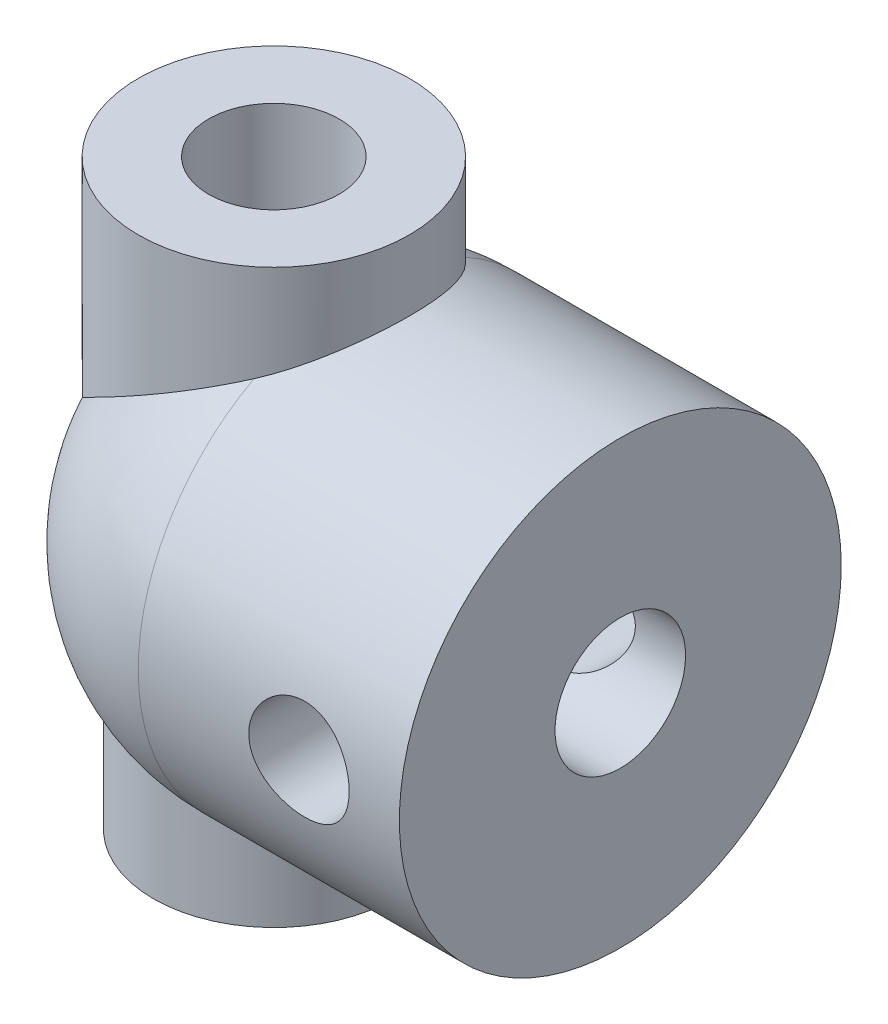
ISO-10303-21;
HEADER;
FILE_DESCRIPTION(('STEP AP214'),'2;1');
FILE_NAME('part.step','',(''),(''),'','','');
FILE_SCHEMA(('AUTOMOTIVE_DESIGN { 1 0 10303 214 1 1 1 1 }'));
ENDSEC;
DATA;
#1=APPLICATION_CONTEXT('core data for automotive mechanical design processes');
#2=APPLICATION_PROTOCOL_DEFINITION('international standard','automotive_design',2000,#1);
#3=PRODUCT_CONTEXT('',#1,'mechanical');
#4=PRODUCT('Part','Part','',(#3));
#5=PRODUCT_RELATED_PRODUCT_CATEGORY('part','',(#4));
#6=PRODUCT_DEFINITION_FORMATION('','',#4);
#7=PRODUCT_DEFINITION_CONTEXT('part definition',#1,'design');
#8=PRODUCT_DEFINITION('design','',#6,#7);
#9=PRODUCT_DEFINITION_SHAPE('','',#8);
#10=(LENGTH_UNIT() NAMED_UNIT(*) SI_UNIT(.MILLI.,.METRE.));
#11=(NAMED_UNIT(*) PLANE_ANGLE_UNIT() SI_UNIT($,.RADIAN.));
#12=(NAMED_UNIT(*) SI_UNIT($,.STERADIAN.) SOLID_ANGLE_UNIT());
#13=UNCERTAINTY_MEASURE_WITH_UNIT(LENGTH_MEASURE(1.E-05),#10,'distance_accuracy_value','');
#14=(GEOMETRIC_REPRESENTATION_CONTEXT(3) GLOBAL_UNCERTAINTY_ASSIGNED_CONTEXT((#13)) GLOBAL_UNIT_ASSIGNED_CONTEXT((#10,
#11,#12)) REPRESENTATION_CONTEXT('',''));
#15=CARTESIAN_POINT('',(0.,0.,0.));
#16=DIRECTION('',(0.,0.,1.));
#17=DIRECTION('',(1.,0.,0.));
#18=AXIS2_PLACEMENT_3D('',#15,#16,#17);
#19=CARTESIAN_POINT('',(104.,0.,0.));
#20=DIRECTION('',(-1.,0.,0.));
#21=DIRECTION('',(0.,0.,1.));
#22=AXIS2_PLACEMENT_3D('',#19,#20,#21);
#23=CYLINDRICAL_SURFACE('',#22,88.);
#24=CARTESIAN_POINT('',(84.,0.,-88.));
#25=CARTESIAN_POINT('',(83.999997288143,0.554129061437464,-87.9999985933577));
#26=CARTESIAN_POINT('',(83.9769510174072,1.10831576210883,-87.9947527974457));
#27=CARTESIAN_POINT('',(83.8849451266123,2.21271357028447,-87.9739113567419));
#28=CARTESIAN_POINT('',(83.8159790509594,2.76292410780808,-87.9583142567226));
#29=CARTESIAN_POINT('',(83.6326433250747,3.85570057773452,-87.9171923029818));
#30=CARTESIAN_POINT('',(83.5182460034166,4.39826164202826,-87.8916613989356));
#31=CARTESIAN_POINT('',(83.2449778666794,5.47151420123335,-87.8313807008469));
#32=CARTESIAN_POINT('',(83.0861085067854,6.0022060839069,-87.796631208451));
#33=CARTESIAN_POINT('',(82.7253420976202,7.0474760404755,-87.7189116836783));
#34=CARTESIAN_POINT('',(82.5234923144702,7.56207110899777,-87.6759506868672));
#35=CARTESIAN_POINT('',(82.078190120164,8.57226627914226,-87.582952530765));
#36=CARTESIAN_POINT('',(81.8347374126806,9.06786624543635,-87.5329153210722));
#37=CARTESIAN_POINT('',(81.308016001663,10.0367636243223,-87.4271175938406));
#38=CARTESIAN_POINT('',(81.024748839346,10.5100618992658,-87.3713572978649));
#39=CARTESIAN_POINT('',(80.4203783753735,11.4313023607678,-87.2556066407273));
#40=CARTESIAN_POINT('',(80.0992746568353,11.8792442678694,-87.1956162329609));
#41=CARTESIAN_POINT('',(79.4161602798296,12.7536084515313,-87.0720589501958));
#42=CARTESIAN_POINT('',(79.0535937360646,13.179590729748,-87.0084511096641));
#43=CARTESIAN_POINT('',(78.2941478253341,13.9996304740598,-86.8802774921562));
#44=CARTESIAN_POINT('',(77.8972681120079,14.3936876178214,-86.8157117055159));
#45=CARTESIAN_POINT('',(77.071800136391,15.1472899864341,-86.6874025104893));
#46=CARTESIAN_POINT('',(76.6432089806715,15.5068320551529,-86.6236591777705));
#47=CARTESIAN_POINT('',(75.757177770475,16.1889267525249,-86.4987797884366));
#48=CARTESIAN_POINT('',(75.299737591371,16.5114792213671,-86.4376437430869));
#49=CARTESIAN_POINT('',(74.3533560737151,17.1209988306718,-86.3189955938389));
#50=CARTESIAN_POINT('',(73.8641014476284,17.4074900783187,-86.2615360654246));
#51=CARTESIAN_POINT('',(72.8624917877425,17.9381561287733,-86.1527478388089));
#52=CARTESIAN_POINT('',(72.3501365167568,18.1823304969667,-86.1014192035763));
#53=CARTESIAN_POINT('',(71.3059685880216,18.6264506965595,-86.0064354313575));
#54=CARTESIAN_POINT('',(70.7741579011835,18.8264009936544,-85.9627795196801));
#55=CARTESIAN_POINT('',(69.6948530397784,19.1804900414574,-85.8844672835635));
#56=CARTESIAN_POINT('',(69.147359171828,19.334629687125,-85.849810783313));
#57=CARTESIAN_POINT('',(68.0499782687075,19.5936257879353,-85.7910670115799));
#58=CARTESIAN_POINT('',(67.5002845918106,19.6992637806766,-85.7668125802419));
#59=CARTESIAN_POINT('',(66.3936204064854,19.8641269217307,-85.728779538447));
#60=CARTESIAN_POINT('',(65.8366499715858,19.9233525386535,-85.7150008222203));
#61=CARTESIAN_POINT('',(64.7196064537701,19.9948833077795,-85.6983430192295));
#62=CARTESIAN_POINT('',(64.1595337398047,20.0071939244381,-85.695462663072));
#63=CARTESIAN_POINT('',(63.0403838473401,19.9848036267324,-85.7006870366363));
#64=CARTESIAN_POINT('',(62.4813066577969,19.9501032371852,-85.7087916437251));
#65=CARTESIAN_POINT('',(61.3793159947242,19.8351412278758,-85.7354684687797));
#66=CARTESIAN_POINT('',(60.8363016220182,19.755795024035,-85.7538303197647));
#67=CARTESIAN_POINT('',(59.7590387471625,19.5528683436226,-85.8003272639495));
#68=CARTESIAN_POINT('',(59.2247901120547,19.4292885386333,-85.8284622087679));
#69=CARTESIAN_POINT('',(58.1687284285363,19.1388660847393,-85.8936896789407));
#70=CARTESIAN_POINT('',(57.6469158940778,18.9720216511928,-85.9307825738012));
#71=CARTESIAN_POINT('',(56.6192719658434,18.5963480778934,-86.0128639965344));
#72=CARTESIAN_POINT('',(56.1134407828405,18.3875183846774,-86.0578526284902));
#73=CARTESIAN_POINT('',(55.1168760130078,17.9274612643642,-86.1548712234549));
#74=CARTESIAN_POINT('',(54.6263076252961,17.6758880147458,-86.2069578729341));
#75=CARTESIAN_POINT('',(53.6680455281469,17.1334136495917,-86.3164101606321));
#76=CARTESIAN_POINT('',(53.2003518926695,16.8425124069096,-86.3737758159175));
#77=CARTESIAN_POINT('',(52.2907970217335,16.2233555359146,-86.4922080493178));
#78=CARTESIAN_POINT('',(51.8489389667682,15.8950953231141,-86.5532750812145));
#79=CARTESIAN_POINT('',(50.9939355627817,15.2034422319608,-86.6774409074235));
#80=CARTESIAN_POINT('',(50.5807906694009,14.8400487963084,-86.7405397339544));
#81=CARTESIAN_POINT('',(49.7765395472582,14.0715919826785,-86.8685530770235));
#82=CARTESIAN_POINT('',(49.3861763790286,13.6657518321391,-86.9334754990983));
#83=CARTESIAN_POINT('',(48.6409383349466,12.8224747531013,-87.061851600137));
#84=CARTESIAN_POINT('',(48.2860640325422,12.3850373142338,-87.1253052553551));
#85=CARTESIAN_POINT('',(47.6142579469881,11.4814804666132,-87.2489741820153));
#86=CARTESIAN_POINT('',(47.2973272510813,11.0153602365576,-87.3091893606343));
#87=CARTESIAN_POINT('',(46.7036908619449,10.057589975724,-87.424696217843));
#88=CARTESIAN_POINT('',(46.4269849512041,9.56594008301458,-87.4799879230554));
#89=CARTESIAN_POINT('',(45.9152200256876,8.55922628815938,-87.5842241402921));
#90=CARTESIAN_POINT('',(45.6802654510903,8.04410760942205,-87.6331526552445));
#91=CARTESIAN_POINT('',(45.2546675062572,6.99520105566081,-87.7231109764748));
#92=CARTESIAN_POINT('',(45.0640243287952,6.46141309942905,-87.7641407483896));
#93=CARTESIAN_POINT('',(44.728610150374,5.37907759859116,-87.8371200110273));
#94=CARTESIAN_POINT('',(44.5838332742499,4.83053195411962,-87.8690706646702));
#95=CARTESIAN_POINT('',(44.3413287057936,3.72265655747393,-87.9229739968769));
#96=CARTESIAN_POINT('',(44.2436000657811,3.16332702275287,-87.9449268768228));
#97=CARTESIAN_POINT('',(44.0976025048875,2.05011072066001,-87.9778408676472));
#98=CARTESIAN_POINT('',(44.0483208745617,1.49636323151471,-87.9890269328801));
#99=CARTESIAN_POINT('',(43.9960220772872,0.386578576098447,-88.0009004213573));
#100=CARTESIAN_POINT('',(43.9930042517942,-0.169458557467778,-88.001587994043));
#101=CARTESIAN_POINT('',(44.0332561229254,-1.27972754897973,-87.9924455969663));
#102=CARTESIAN_POINT('',(44.0765226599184,-1.83395952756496,-87.9826163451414));
#103=CARTESIAN_POINT('',(44.2089773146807,-2.93662615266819,-87.952716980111));
#104=CARTESIAN_POINT('',(44.2981652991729,-3.48506081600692,-87.9326468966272));
#105=CARTESIAN_POINT('',(44.5203881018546,-4.56567121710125,-87.8831253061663));
#106=CARTESIAN_POINT('',(44.6528850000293,-5.09796301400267,-87.8537890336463));
#107=CARTESIAN_POINT('',(44.9609494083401,-6.14936071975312,-87.7864617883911));
#108=CARTESIAN_POINT('',(45.1365164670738,-6.66846676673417,-87.748470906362));
#109=CARTESIAN_POINT('',(45.5294019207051,-7.69002724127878,-87.664851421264));
#110=CARTESIAN_POINT('',(45.7467230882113,-8.19248056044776,-87.6192223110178));
#111=CARTESIAN_POINT('',(46.2215196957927,-9.17739197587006,-87.5215425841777));
#112=CARTESIAN_POINT('',(46.4789957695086,-9.65984975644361,-87.4694918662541));
#113=CARTESIAN_POINT('',(47.0364987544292,-10.6088194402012,-87.3595134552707));
#114=CARTESIAN_POINT('',(47.3371133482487,-11.0749771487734,-87.3015084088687));
#115=CARTESIAN_POINT('',(47.9757544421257,-11.9804210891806,-87.1818679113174));
#116=CARTESIAN_POINT('',(48.313781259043,-12.4197070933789,-87.1202324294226));
#117=CARTESIAN_POINT('',(49.0250019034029,-13.2686128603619,-86.9949886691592));
#118=CARTESIAN_POINT('',(49.3982000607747,-13.6782289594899,-86.9313801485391));
#119=CARTESIAN_POINT('',(50.1772654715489,-14.4650800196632,-86.8039189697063));
#120=CARTESIAN_POINT('',(50.583133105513,-14.8423146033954,-86.740066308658));
#121=CARTESIAN_POINT('',(51.4333386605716,-15.569136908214,-86.6125906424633));
#122=CARTESIAN_POINT('',(51.8782843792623,-15.9180193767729,-86.5489978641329));
#123=CARTESIAN_POINT('',(52.7964310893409,-16.5770741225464,-86.4251877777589));
#124=CARTESIAN_POINT('',(53.2696325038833,-16.8872458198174,-86.3649705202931));
#125=CARTESIAN_POINT('',(54.2410668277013,-17.4666267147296,-86.2496622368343));
#126=CARTESIAN_POINT('',(54.739299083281,-17.7358369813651,-86.1945710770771));
#127=CARTESIAN_POINT('',(55.757368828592,-18.2312780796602,-86.0911411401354));
#128=CARTESIAN_POINT('',(56.2772060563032,-18.4575094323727,-86.0428022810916));
#129=CARTESIAN_POINT('',(57.3317366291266,-18.8640323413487,-85.9545887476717));
#130=CARTESIAN_POINT('',(57.8663255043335,-19.0445844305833,-85.9146662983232));
#131=CARTESIAN_POINT('',(58.9494232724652,-19.3600054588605,-85.8441398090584));
#132=CARTESIAN_POINT('',(59.4979321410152,-19.4948744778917,-85.813535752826));
#133=CARTESIAN_POINT('',(60.6047739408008,-19.7177860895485,-85.7625909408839));
#134=CARTESIAN_POINT('',(61.1631054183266,-19.8058355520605,-85.7422486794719));
#135=CARTESIAN_POINT('',(62.2855011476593,-19.9343810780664,-85.7124543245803));
#136=CARTESIAN_POINT('',(62.8495652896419,-19.9748780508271,-85.7030020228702));
#137=CARTESIAN_POINT('',(63.9658137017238,-20.0075787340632,-85.695373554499));
#138=CARTESIAN_POINT('',(64.5179637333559,-20.0009010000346,-85.6969362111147));
#139=CARTESIAN_POINT('',(65.6196832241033,-19.9419389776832,-85.7106760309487));
#140=CARTESIAN_POINT('',(66.1692527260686,-19.8896554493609,-85.722853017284));
#141=CARTESIAN_POINT('',(67.2618594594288,-19.7399170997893,-85.7574577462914));
#142=CARTESIAN_POINT('',(67.8048968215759,-19.6424631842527,-85.7798852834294));
#143=CARTESIAN_POINT('',(68.8806109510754,-19.4031761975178,-85.8343275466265));
#144=CARTESIAN_POINT('',(69.4132876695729,-19.2613429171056,-85.8663423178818));
#145=CARTESIAN_POINT('',(70.4624342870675,-18.9350866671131,-85.9388752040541));
#146=CARTESIAN_POINT('',(70.9789614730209,-18.7508399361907,-85.9793580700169));
#147=CARTESIAN_POINT('',(71.9946004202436,-18.3408362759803,-86.0677504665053));
#148=CARTESIAN_POINT('',(72.4937122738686,-18.1150795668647,-86.1156599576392));
#149=CARTESIAN_POINT('',(73.4712942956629,-17.623674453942,-86.2175680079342));
#150=CARTESIAN_POINT('',(73.9497626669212,-17.3580225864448,-86.2715670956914));
#151=CARTESIAN_POINT('',(74.8829459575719,-16.7886939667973,-86.3841647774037));
#152=CARTESIAN_POINT('',(75.3376604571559,-16.4850165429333,-86.4427634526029));
#153=CARTESIAN_POINT('',(76.2300707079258,-15.8346707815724,-86.5642822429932));
#154=CARTESIAN_POINT('',(76.667180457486,-15.4872104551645,-86.6272686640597));
#155=CARTESIAN_POINT('',(77.5107228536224,-14.7570845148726,-86.7546295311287));
#156=CARTESIAN_POINT('',(77.9171550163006,-14.3744183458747,-86.8190039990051));
#157=CARTESIAN_POINT('',(78.6967442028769,-13.5763378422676,-86.9473771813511));
#158=CARTESIAN_POINT('',(79.0698936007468,-13.1609160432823,-87.0113758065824));
#159=CARTESIAN_POINT('',(79.7803030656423,-12.3001398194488,-87.1372234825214));
#160=CARTESIAN_POINT('',(80.1175632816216,-11.8547855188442,-87.1990725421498));
#161=CARTESIAN_POINT('',(80.7584158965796,-10.93051799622,-87.3197802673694));
#162=CARTESIAN_POINT('',(81.0614591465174,-10.451216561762,-87.3785836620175));
#163=CARTESIAN_POINT('',(81.6260224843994,-9.46808608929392,-87.4905713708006));
#164=CARTESIAN_POINT('',(81.8875404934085,-8.96425582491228,-87.543755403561));
#165=CARTESIAN_POINT('',(82.3668636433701,-7.93598620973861,-87.6429501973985));
#166=CARTESIAN_POINT('',(82.5847004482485,-7.41156211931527,-87.6889661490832));
#167=CARTESIAN_POINT('',(82.9751463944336,-6.34554168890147,-87.7725455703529));
#168=CARTESIAN_POINT('',(83.1477632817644,-5.80394830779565,-87.8101104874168));
#169=CARTESIAN_POINT('',(83.4134013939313,-4.82865541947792,-87.8684662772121));
#170=CARTESIAN_POINT('',(83.5155817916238,-4.39753625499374,-87.8911294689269));
#171=CARTESIAN_POINT('',(83.6911615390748,-3.52908202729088,-87.930281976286));
#172=CARTESIAN_POINT('',(83.7645548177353,-3.09174567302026,-87.9467699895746));
#173=CARTESIAN_POINT('',(83.8821325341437,-2.21298636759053,-87.9732681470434));
#174=CARTESIAN_POINT('',(83.9263181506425,-1.77156358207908,-87.9832785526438));
#175=CARTESIAN_POINT('',(83.9852497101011,-0.886772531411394,-87.996644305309));
#176=CARTESIAN_POINT('',(84.0000021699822,-0.443404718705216,-88.0000011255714));
#177=CARTESIAN_POINT('',(84.,0.,-88.));
#178=B_SPLINE_CURVE_WITH_KNOTS('',3,(#24,#25,#26,#27,#28,#29,#30,#31,#32,#33,#34,#35,#36,#37,
#38,#39,#40,#41,#42,#43,#44,#45,#46,#47,#48,#49,#50,#51,#52,#53,#54,#55,#56,#57,#58,#59,#60,#61,
#62,#63,#64,#65,#66,#67,#68,#69,#70,#71,#72,#73,#74,#75,#76,#77,#78,#79,#80,#81,#82,#83,#84,#85,
#86,#87,#88,#89,#90,#91,#92,#93,#94,#95,#96,#97,#98,#99,#100,#101,#102,#103,#104,#105,#106,#107,
#108,#109,#110,#111,#112,#113,#114,#115,#116,#117,#118,#119,#120,#121,#122,#123,#124,#125,#126,
#127,#128,#129,#130,#131,#132,#133,#134,#135,#136,#137,#138,#139,#140,#141,#142,#143,#144,#145,
#146,#147,#148,#149,#150,#151,#152,#153,#154,#155,#156,#157,#158,#159,#160,#161,#162,#163,#164,
#165,#166,#167,#168,#169,#170,#171,#172,#173,#174,#175,#176,#177),.UNSPECIFIED.,.T.,.F.,(4,2,2,
2,2,2,2,2,2,2,2,2,2,2,2,2,2,2,2,2,2,2,2,2,2,2,2,2,2,2,2,2,2,2,2,2,2,2,2,2,2,2,2,2,2,2,2,2,2,2,2,
2,2,2,2,2,2,2,2,2,2,2,2,2,2,2,2,2,2,2,2,2,2,2,2,2,4),(0.,1.66198472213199,3.32420314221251,
4.98743554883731,6.65061353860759,8.31197187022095,9.97334203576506,11.6346479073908,
13.2959720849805,14.9829916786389,16.6700283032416,18.3572190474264,20.0444170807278,
21.751955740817,23.4595119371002,25.1668956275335,26.8742459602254,28.5530256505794,
30.2317883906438,31.9103555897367,33.5889040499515,35.2342279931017,36.8795269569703,
38.5248937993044,40.1702823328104,41.8296791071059,43.489081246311,45.1486872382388,
46.8083195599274,48.5068327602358,50.2053734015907,51.9039627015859,53.6025428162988,
55.3053138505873,57.0080922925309,58.7106525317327,60.4131784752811,62.0793069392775,
63.7454116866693,65.4114027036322,67.0773888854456,68.7234225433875,70.3694389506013,
72.0155646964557,73.6617164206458,75.3329084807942,77.0041146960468,78.6755269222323,
80.346958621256,82.0518745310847,83.7568159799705,85.4617129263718,87.1665892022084,
88.8615105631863,90.5564289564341,92.2510985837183,93.9457358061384,95.600328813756,
97.2548942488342,98.9094265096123,100.563966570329,102.211751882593,103.859528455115,
105.507448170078,107.155396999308,108.839221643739,110.523072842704,112.207308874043,
113.891537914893,115.599802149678,117.308151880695,119.015258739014,120.722072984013,
122.052033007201,123.382273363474,124.712460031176,126.042352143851),.UNSPECIFIED.);
#179=CARTESIAN_POINT('',(84.,0.,-88.));
#180=VERTEX_POINT('',#179);
#181=EDGE_CURVE('E91',#180,#180,#178,.T.);
#182=ORIENTED_EDGE('',*,*,#181,.T.);
#183=EDGE_LOOP('',(#182));
#184=FACE_BOUND('',#183,.T.);
#185=CARTESIAN_POINT('',(84.,0.,88.));
#186=CARTESIAN_POINT('',(83.999997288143,-0.554129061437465,87.9999985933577));
#187=CARTESIAN_POINT('',(83.9769510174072,-1.10831576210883,87.9947527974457));
#188=CARTESIAN_POINT('',(83.8849451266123,-2.21271357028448,87.9739113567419));
#189=CARTESIAN_POINT('',(83.8159790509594,-2.76292410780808,87.9583142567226));
#190=CARTESIAN_POINT('',(83.6326433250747,-3.85570057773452,87.9171923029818));
#191=CARTESIAN_POINT('',(83.5182460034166,-4.39826164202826,87.8916613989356));
#192=CARTESIAN_POINT('',(83.2449778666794,-5.47151420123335,87.8313807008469));
#193=CARTESIAN_POINT('',(83.0861085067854,-6.0022060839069,87.796631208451));
#194=CARTESIAN_POINT('',(82.7253420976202,-7.0474760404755,87.7189116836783));
#195=CARTESIAN_POINT('',(82.5234923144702,-7.56207110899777,87.6759506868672));
#196=CARTESIAN_POINT('',(82.078190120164,-8.57226627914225,87.582952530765));
#197=CARTESIAN_POINT('',(81.8347374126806,-9.06786624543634,87.5329153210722));
#198=CARTESIAN_POINT('',(81.308016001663,-10.0367636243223,87.4271175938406));
#199=CARTESIAN_POINT('',(81.024748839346,-10.5100618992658,87.3713572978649));
#200=CARTESIAN_POINT('',(80.4203783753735,-11.4313023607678,87.2556066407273));
#201=CARTESIAN_POINT('',(80.0992746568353,-11.8792442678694,87.1956162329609));
#202=CARTESIAN_POINT('',(79.4161602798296,-12.7536084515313,87.0720589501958));
#203=CARTESIAN_POINT('',(79.0535937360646,-13.179590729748,87.0084511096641));
#204=CARTESIAN_POINT('',(78.2941478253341,-13.9996304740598,86.8802774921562));
#205=CARTESIAN_POINT('',(77.8972681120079,-14.3936876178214,86.8157117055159));
#206=CARTESIAN_POINT('',(77.071800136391,-15.1472899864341,86.6874025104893));
#207=CARTESIAN_POINT('',(76.6432089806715,-15.5068320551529,86.6236591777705));
#208=CARTESIAN_POINT('',(75.757177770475,-16.1889267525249,86.4987797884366));
#209=CARTESIAN_POINT('',(75.299737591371,-16.5114792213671,86.4376437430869));
#210=CARTESIAN_POINT('',(74.3533560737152,-17.1209988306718,86.3189955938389));
#211=CARTESIAN_POINT('',(73.8641014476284,-17.4074900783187,86.2615360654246));
#212=CARTESIAN_POINT('',(72.8624917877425,-17.9381561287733,86.1527478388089));
#213=CARTESIAN_POINT('',(72.3501365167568,-18.1823304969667,86.1014192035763));
#214=CARTESIAN_POINT('',(71.3059685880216,-18.6264506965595,86.0064354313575));
#215=CARTESIAN_POINT('',(70.7741579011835,-18.8264009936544,85.9627795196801));
#216=CARTESIAN_POINT('',(69.6948530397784,-19.1804900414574,85.8844672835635));
#217=CARTESIAN_POINT('',(69.147359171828,-19.334629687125,85.849810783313));
#218=CARTESIAN_POINT('',(68.0499782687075,-19.5936257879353,85.7910670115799));
#219=CARTESIAN_POINT('',(67.5002845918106,-19.6992637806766,85.7668125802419));
#220=CARTESIAN_POINT('',(66.3936204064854,-19.8641269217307,85.728779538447));
#221=CARTESIAN_POINT('',(65.8366499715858,-19.9233525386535,85.7150008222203));
#222=CARTESIAN_POINT('',(64.7196064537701,-19.9948833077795,85.6983430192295));
#223=CARTESIAN_POINT('',(64.1595337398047,-20.0071939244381,85.695462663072));
#224=CARTESIAN_POINT('',(63.0403838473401,-19.9848036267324,85.7006870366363));
#225=CARTESIAN_POINT('',(62.4813066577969,-19.9501032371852,85.7087916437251));
#226=CARTESIAN_POINT('',(61.3793159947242,-19.8351412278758,85.7354684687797));
#227=CARTESIAN_POINT('',(60.8363016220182,-19.755795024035,85.7538303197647));
#228=CARTESIAN_POINT('',(59.7590387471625,-19.5528683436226,85.8003272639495));
#229=CARTESIAN_POINT('',(59.2247901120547,-19.4292885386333,85.8284622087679));
#230=CARTESIAN_POINT('',(58.1687284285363,-19.1388660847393,85.8936896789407));
#231=CARTESIAN_POINT('',(57.6469158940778,-18.9720216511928,85.9307825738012));
#232=CARTESIAN_POINT('',(56.6192719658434,-18.5963480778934,86.0128639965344));
#233=CARTESIAN_POINT('',(56.1134407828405,-18.3875183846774,86.0578526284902));
#234=CARTESIAN_POINT('',(55.1168760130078,-17.9274612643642,86.1548712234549));
#235=CARTESIAN_POINT('',(54.6263076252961,-17.6758880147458,86.2069578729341));
#236=CARTESIAN_POINT('',(53.6680455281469,-17.1334136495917,86.3164101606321));
#237=CARTESIAN_POINT('',(53.2003518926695,-16.8425124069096,86.3737758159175));
#238=CARTESIAN_POINT('',(52.2907970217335,-16.2233555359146,86.4922080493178));
#239=CARTESIAN_POINT('',(51.8489389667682,-15.8950953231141,86.5532750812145));
#240=CARTESIAN_POINT('',(50.9939355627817,-15.2034422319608,86.6774409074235));
#241=CARTESIAN_POINT('',(50.5807906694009,-14.8400487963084,86.7405397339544));
#242=CARTESIAN_POINT('',(49.7765395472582,-14.0715919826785,86.8685530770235));
#243=CARTESIAN_POINT('',(49.3861763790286,-13.6657518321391,86.9334754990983));
#244=CARTESIAN_POINT('',(48.6409383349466,-12.8224747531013,87.061851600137));
#245=CARTESIAN_POINT('',(48.2860640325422,-12.3850373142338,87.1253052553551));
#246=CARTESIAN_POINT('',(47.6142579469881,-11.4814804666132,87.2489741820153));
#247=CARTESIAN_POINT('',(47.2973272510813,-11.0153602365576,87.3091893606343));
#248=CARTESIAN_POINT('',(46.7036908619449,-10.057589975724,87.424696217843));
#249=CARTESIAN_POINT('',(46.4269849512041,-9.56594008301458,87.4799879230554));
#250=CARTESIAN_POINT('',(45.9152200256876,-8.55922628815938,87.5842241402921));
#251=CARTESIAN_POINT('',(45.6802654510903,-8.04410760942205,87.6331526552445));
#252=CARTESIAN_POINT('',(45.2546675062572,-6.99520105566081,87.7231109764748));
#253=CARTESIAN_POINT('',(45.0640243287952,-6.46141309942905,87.7641407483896));
#254=CARTESIAN_POINT('',(44.728610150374,-5.37907759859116,87.8371200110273));
#255=CARTESIAN_POINT('',(44.5838332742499,-4.83053195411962,87.8690706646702));
#256=CARTESIAN_POINT('',(44.3413287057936,-3.72265655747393,87.9229739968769));
#257=CARTESIAN_POINT('',(44.2436000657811,-3.16332702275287,87.9449268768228));
#258=CARTESIAN_POINT('',(44.0976025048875,-2.05011072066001,87.9778408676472));
#259=CARTESIAN_POINT('',(44.0483208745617,-1.49636323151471,87.9890269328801));
#260=CARTESIAN_POINT('',(43.9960220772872,-0.386578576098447,88.0009004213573));
#261=CARTESIAN_POINT('',(43.9930042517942,0.169458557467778,88.001587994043));
#262=CARTESIAN_POINT('',(44.0332561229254,1.27972754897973,87.9924455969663));
#263=CARTESIAN_POINT('',(44.0765226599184,1.83395952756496,87.9826163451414));
#264=CARTESIAN_POINT('',(44.2089773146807,2.93662615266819,87.952716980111));
#265=CARTESIAN_POINT('',(44.2981652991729,3.48506081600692,87.9326468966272));
#266=CARTESIAN_POINT('',(44.5203881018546,4.56567121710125,87.8831253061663));
#267=CARTESIAN_POINT('',(44.6528850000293,5.09796301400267,87.8537890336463));
#268=CARTESIAN_POINT('',(44.9609494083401,6.14936071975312,87.7864617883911));
#269=CARTESIAN_POINT('',(45.1365164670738,6.66846676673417,87.748470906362));
#270=CARTESIAN_POINT('',(45.5294019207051,7.69002724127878,87.664851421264));
#271=CARTESIAN_POINT('',(45.7467230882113,8.19248056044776,87.6192223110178));
#272=CARTESIAN_POINT('',(46.2215196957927,9.17739197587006,87.5215425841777));
#273=CARTESIAN_POINT('',(46.4789957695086,9.65984975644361,87.4694918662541));
#274=CARTESIAN_POINT('',(47.0364987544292,10.6088194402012,87.3595134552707));
#275=CARTESIAN_POINT('',(47.3371133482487,11.0749771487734,87.3015084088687));
#276=CARTESIAN_POINT('',(47.9757544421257,11.9804210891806,87.1818679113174));
#277=CARTESIAN_POINT('',(48.313781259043,12.4197070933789,87.1202324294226));
#278=CARTESIAN_POINT('',(49.0250019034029,13.2686128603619,86.9949886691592));
#279=CARTESIAN_POINT('',(49.3982000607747,13.6782289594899,86.9313801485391));
#280=CARTESIAN_POINT('',(50.1772654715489,14.4650800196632,86.8039189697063));
#281=CARTESIAN_POINT('',(50.583133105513,14.8423146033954,86.740066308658));
#282=CARTESIAN_POINT('',(51.4333386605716,15.569136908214,86.6125906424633));
#283=CARTESIAN_POINT('',(51.8782843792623,15.9180193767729,86.5489978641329));
#284=CARTESIAN_POINT('',(52.7964310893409,16.5770741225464,86.4251877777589));
#285=CARTESIAN_POINT('',(53.2696325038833,16.8872458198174,86.3649705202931));
#286=CARTESIAN_POINT('',(54.2410668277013,17.4666267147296,86.2496622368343));
#287=CARTESIAN_POINT('',(54.739299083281,17.7358369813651,86.1945710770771));
#288=CARTESIAN_POINT('',(55.757368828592,18.2312780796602,86.0911411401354));
#289=CARTESIAN_POINT('',(56.2772060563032,18.4575094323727,86.0428022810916));
#290=CARTESIAN_POINT('',(57.3317366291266,18.8640323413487,85.9545887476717));
#291=CARTESIAN_POINT('',(57.8663255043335,19.0445844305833,85.9146662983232));
#292=CARTESIAN_POINT('',(58.9494232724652,19.3600054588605,85.8441398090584));
#293=CARTESIAN_POINT('',(59.4979321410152,19.4948744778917,85.813535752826));
#294=CARTESIAN_POINT('',(60.6047739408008,19.7177860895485,85.7625909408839));
#295=CARTESIAN_POINT('',(61.1631054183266,19.8058355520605,85.7422486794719));
#296=CARTESIAN_POINT('',(62.2855011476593,19.9343810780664,85.7124543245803));
#297=CARTESIAN_POINT('',(62.8495652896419,19.9748780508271,85.7030020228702));
#298=CARTESIAN_POINT('',(63.9658137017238,20.0075787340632,85.695373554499));
#299=CARTESIAN_POINT('',(64.5179637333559,20.0009010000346,85.6969362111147));
#300=CARTESIAN_POINT('',(65.6196832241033,19.9419389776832,85.7106760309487));
#301=CARTESIAN_POINT('',(66.1692527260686,19.8896554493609,85.722853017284));
#302=CARTESIAN_POINT('',(67.2618594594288,19.7399170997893,85.7574577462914));
#303=CARTESIAN_POINT('',(67.8048968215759,19.6424631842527,85.7798852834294));
#304=CARTESIAN_POINT('',(68.8806109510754,19.4031761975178,85.8343275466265));
#305=CARTESIAN_POINT('',(69.4132876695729,19.2613429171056,85.8663423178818));
#306=CARTESIAN_POINT('',(70.4624342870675,18.9350866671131,85.9388752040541));
#307=CARTESIAN_POINT('',(70.9789614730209,18.7508399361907,85.9793580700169));
#308=CARTESIAN_POINT('',(71.9946004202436,18.3408362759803,86.0677504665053));
#309=CARTESIAN_POINT('',(72.4937122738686,18.1150795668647,86.1156599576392));
#310=CARTESIAN_POINT('',(73.4712942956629,17.623674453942,86.2175680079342));
#311=CARTESIAN_POINT('',(73.9497626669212,17.3580225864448,86.2715670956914));
#312=CARTESIAN_POINT('',(74.8829459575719,16.7886939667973,86.3841647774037));
#313=CARTESIAN_POINT('',(75.3376604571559,16.4850165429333,86.4427634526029));
#314=CARTESIAN_POINT('',(76.2300707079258,15.8346707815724,86.5642822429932));
#315=CARTESIAN_POINT('',(76.667180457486,15.4872104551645,86.6272686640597));
#316=CARTESIAN_POINT('',(77.5107228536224,14.7570845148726,86.7546295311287));
#317=CARTESIAN_POINT('',(77.9171550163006,14.3744183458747,86.8190039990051));
#318=CARTESIAN_POINT('',(78.6967442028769,13.5763378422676,86.9473771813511));
#319=CARTESIAN_POINT('',(79.0698936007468,13.1609160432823,87.0113758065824));
#320=CARTESIAN_POINT('',(79.7803030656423,12.3001398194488,87.1372234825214));
#321=CARTESIAN_POINT('',(80.1175632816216,11.8547855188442,87.1990725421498));
#322=CARTESIAN_POINT('',(80.7584158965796,10.93051799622,87.3197802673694));
#323=CARTESIAN_POINT('',(81.0614591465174,10.451216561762,87.3785836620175));
#324=CARTESIAN_POINT('',(81.6260224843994,9.46808608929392,87.4905713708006));
#325=CARTESIAN_POINT('',(81.8875404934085,8.96425582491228,87.543755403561));
#326=CARTESIAN_POINT('',(82.3668636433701,7.93598620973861,87.6429501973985));
#327=CARTESIAN_POINT('',(82.5847004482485,7.41156211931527,87.6889661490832));
#328=CARTESIAN_POINT('',(82.9751463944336,6.34554168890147,87.7725455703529));
#329=CARTESIAN_POINT('',(83.1477632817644,5.80394830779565,87.8101104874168));
#330=CARTESIAN_POINT('',(83.4134013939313,4.82865541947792,87.8684662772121));
#331=CARTESIAN_POINT('',(83.5155817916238,4.39753625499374,87.8911294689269));
#332=CARTESIAN_POINT('',(83.6911615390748,3.52908202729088,87.930281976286));
#333=CARTESIAN_POINT('',(83.7645548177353,3.09174567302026,87.9467699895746));
#334=CARTESIAN_POINT('',(83.8821325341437,2.21298636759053,87.9732681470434));
#335=CARTESIAN_POINT('',(83.9263181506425,1.77156358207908,87.9832785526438));
#336=CARTESIAN_POINT('',(83.9852497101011,0.886772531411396,87.996644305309));
#337=CARTESIAN_POINT('',(84.0000021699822,0.443404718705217,88.0000011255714));
#338=CARTESIAN_POINT('',(84.,0.,88.));
#339=B_SPLINE_CURVE_WITH_KNOTS('',3,(#185,#186,#187,#188,#189,#190,#191,#192,#193,#194,#195,
#196,#197,#198,#199,#200,#201,#202,#203,#204,#205,#206,#207,#208,#209,#210,#211,#212,#213,#214,
#215,#216,#217,#218,#219,#220,#221,#222,#223,#224,#225,#226,#227,#228,#229,#230,#231,#232,#233,
#234,#235,#236,#237,#238,#239,#240,#241,#242,#243,#244,#245,#246,#247,#248,#249,#250,#251,#252,
#253,#254,#255,#256,#257,#258,#259,#260,#261,#262,#263,#264,#265,#266,#267,#268,#269,#270,#271,
#272,#273,#274,#275,#276,#277,#278,#279,#280,#281,#282,#283,#284,#285,#286,#287,#288,#289,#290,
#291,#292,#293,#294,#295,#296,#297,#298,#299,#300,#301,#302,#303,#304,#305,#306,#307,#308,#309,
#310,#311,#312,#313,#314,#315,#316,#317,#318,#319,#320,#321,#322,#323,#324,#325,#326,#327,#328,
#329,#330,#331,#332,#333,#334,#335,#336,#337,#338),.UNSPECIFIED.,.T.,.F.,(4,2,2,2,2,2,2,2,2,2,2,
2,2,2,2,2,2,2,2,2,2,2,2,2,2,2,2,2,2,2,2,2,2,2,2,2,2,2,2,2,2,2,2,2,2,2,2,2,2,2,2,2,2,2,2,2,2,2,2,
2,2,2,2,2,2,2,2,2,2,2,2,2,2,2,2,2,4),(0.,1.66198472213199,3.32420314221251,4.98743554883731,
6.65061353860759,8.31197187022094,9.97334203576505,11.6346479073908,13.2959720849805,
14.9829916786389,16.6700283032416,18.3572190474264,20.0444170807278,21.751955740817,
23.4595119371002,25.1668956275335,26.8742459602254,28.5530256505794,30.2317883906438,
31.9103555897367,33.5889040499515,35.2342279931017,36.8795269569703,38.5248937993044,
40.1702823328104,41.8296791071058,43.489081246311,45.1486872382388,46.8083195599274,
48.5068327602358,50.2053734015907,51.9039627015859,53.6025428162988,55.3053138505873,
57.0080922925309,58.7106525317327,60.4131784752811,62.0793069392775,63.7454116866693,
65.4114027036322,67.0773888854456,68.7234225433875,70.3694389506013,72.0155646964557,
73.6617164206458,75.3329084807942,77.0041146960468,78.6755269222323,80.346958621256,
82.0518745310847,83.7568159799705,85.4617129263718,87.1665892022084,88.8615105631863,
90.5564289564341,92.2510985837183,93.9457358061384,95.600328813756,97.2548942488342,
98.9094265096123,100.563966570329,102.211751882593,103.859528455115,105.507448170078,
107.155396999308,108.839221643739,110.523072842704,112.207308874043,113.891537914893,
115.599802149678,117.308151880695,119.015258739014,120.722072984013,122.052033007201,
123.382273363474,124.712460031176,126.042352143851),.UNSPECIFIED.);
#340=CARTESIAN_POINT('',(84.,0.,88.));
#341=VERTEX_POINT('',#340);
#342=EDGE_CURVE('E169',#341,#341,#339,.T.);
#343=ORIENTED_EDGE('',*,*,#342,.T.);
#344=EDGE_LOOP('',(#343));
#345=FACE_BOUND('',#344,.T.);
#346=CARTESIAN_POINT('',(104.,0.,0.));
#347=DIRECTION('',(1.,0.,0.));
#348=DIRECTION('',(0.,0.,-1.));
#349=AXIS2_PLACEMENT_3D('',#346,#347,#348);
#350=CIRCLE('',#349,88.);
#351=CARTESIAN_POINT('',(104.,0.,-88.));
#352=VERTEX_POINT('',#351);
#353=EDGE_CURVE('E137',#352,#352,#350,.T.);
#354=ORIENTED_EDGE('',*,*,#353,.F.);
#355=EDGE_LOOP('',(#354));
#356=FACE_BOUND('',#355,.T.);
#357=CARTESIAN_POINT('',(0.,0.,0.));
#358=DIRECTION('',(-1.,0.,0.));
#359=DIRECTION('',(0.,0.,1.));
#360=AXIS2_PLACEMENT_3D('',#357,#358,#359);
#361=CIRCLE('',#360,88.);
#362=CARTESIAN_POINT('',(0.,-81.2157620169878,33.8821486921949));
#363=VERTEX_POINT('',#362);
#364=CARTESIAN_POINT('',(0.,77.3563184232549,41.9523539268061));
#365=VERTEX_POINT('',#364);
#366=EDGE_CURVE('E142',#363,#365,#361,.T.);
#367=ORIENTED_EDGE('',*,*,#366,.F.);
#368=CARTESIAN_POINT('',(-34.,-73.7563556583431,48.));
#369=CARTESIAN_POINT('',(-33.3837927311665,-73.7563548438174,48.0000005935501));
#370=CARTESIAN_POINT('',(-32.7676003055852,-73.764084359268,47.9881303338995));
#371=CARTESIAN_POINT('',(-31.5364535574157,-73.7949208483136,47.9406973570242));
#372=CARTESIAN_POINT('',(-30.9214993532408,-73.8180292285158,47.905132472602));
#373=CARTESIAN_POINT('',(-29.6940166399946,-73.879400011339,47.8104325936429));
#374=CARTESIAN_POINT('',(-29.0814887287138,-73.9176659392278,47.7512921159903));
#375=CARTESIAN_POINT('',(-27.8602219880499,-74.0089569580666,47.6096759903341));
#376=CARTESIAN_POINT('',(-27.2514835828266,-74.06198367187,47.5271977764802));
#377=CARTESIAN_POINT('',(-25.4311051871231,-74.2426334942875,47.2449186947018));
#378=CARTESIAN_POINT('',(-24.226740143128,-74.3917525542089,47.0103850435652));
#379=CARTESIAN_POINT('',(-21.8469238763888,-74.7416246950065,46.4520982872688));
#380=CARTESIAN_POINT('',(-20.671471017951,-74.9423748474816,46.1283502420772));
#381=CARTESIAN_POINT('',(-18.3634746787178,-75.3871775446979,45.3977426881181));
#382=CARTESIAN_POINT('',(-17.230710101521,-75.6309535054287,44.9914116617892));
#383=CARTESIAN_POINT('',(-15.0061630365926,-76.1550842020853,44.0984236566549));
#384=CARTESIAN_POINT('',(-13.9143809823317,-76.4354393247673,43.6117658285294));
#385=CARTESIAN_POINT('',(-11.7762866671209,-77.0249125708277,42.562014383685));
#386=CARTESIAN_POINT('',(-10.7299770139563,-77.3340323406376,41.9989163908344));
#387=CARTESIAN_POINT('',(-8.68663543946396,-77.9732293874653,40.7999631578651));
#388=CARTESIAN_POINT('',(-7.68960614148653,-78.3033077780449,40.1641040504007));
#389=CARTESIAN_POINT('',(-5.65168998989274,-79.0102825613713,38.7563610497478));
#390=CARTESIAN_POINT('',(-4.61628029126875,-79.3885731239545,37.9772397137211));
#391=CARTESIAN_POINT('',(-2.61313449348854,-80.1515911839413,36.3392185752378));
#392=CARTESIAN_POINT('',(-1.64540184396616,-80.536319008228,35.4803147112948));
#393=CARTESIAN_POINT('',(0.218726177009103,-81.3031307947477,33.6860968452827));
#394=CARTESIAN_POINT('',(1.11508179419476,-81.685213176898,32.7507408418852));
#395=CARTESIAN_POINT('',(2.83141382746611,-82.4376013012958,30.8079074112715));
#396=CARTESIAN_POINT('',(3.65138731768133,-82.8079065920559,29.8004272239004));
#397=CARTESIAN_POINT('',(5.27578629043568,-83.5585161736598,27.6297209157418));
#398=CARTESIAN_POINT('',(6.07308523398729,-83.937035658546,26.4605240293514));
#399=CARTESIAN_POINT('',(7.56547389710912,-84.6596853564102,24.0483431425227));
#400=CARTESIAN_POINT('',(8.26055633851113,-85.0038131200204,22.8053538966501));
#401=CARTESIAN_POINT('',(9.54097453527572,-85.6475938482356,20.2538762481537));
#402=CARTESIAN_POINT('',(10.1263730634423,-85.9472722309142,18.9454258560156));
#403=CARTESIAN_POINT('',(11.1807051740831,-86.4933094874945,16.2716974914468));
#404=CARTESIAN_POINT('',(11.6496539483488,-86.7396753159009,14.9064269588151));
#405=CARTESIAN_POINT('',(12.4310628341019,-87.1535607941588,12.2441834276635));
#406=CARTESIAN_POINT('',(12.7532055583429,-87.3258910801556,10.9507974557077));
#407=CARTESIAN_POINT('',(13.2895205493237,-87.6141967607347,8.33561398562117));
#408=CARTESIAN_POINT('',(13.5036982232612,-87.7301749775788,7.013817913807));
#409=CARTESIAN_POINT('',(13.8208775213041,-87.9023241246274,4.35391095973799));
#410=CARTESIAN_POINT('',(13.9239484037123,-87.9585323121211,3.01581076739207));
#411=CARTESIAN_POINT('',(14.0175706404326,-88.009575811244,0.33455093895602));
#412=CARTESIAN_POINT('',(14.0081307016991,-88.0044158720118,-1.00860829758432));
#413=CARTESIAN_POINT('',(13.8837025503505,-87.9366071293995,-3.54938799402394));
#414=CARTESIAN_POINT('',(13.7797048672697,-87.8799447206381,-4.74772625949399));
#415=CARTESIAN_POINT('',(13.4826718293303,-87.7188036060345,-7.12996653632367));
#416=CARTESIAN_POINT('',(13.2896439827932,-87.6143289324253,-8.31386975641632));
#417=CARTESIAN_POINT('',(12.8167916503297,-87.3600155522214,-10.6592368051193));
#418=CARTESIAN_POINT('',(12.5369641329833,-87.2101752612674,-11.8206998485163));
#419=CARTESIAN_POINT('',(11.8935448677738,-86.8685396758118,-14.1138525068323));
#420=CARTESIAN_POINT('',(11.5299498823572,-86.6767427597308,-15.2455409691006));
#421=CARTESIAN_POINT('',(10.7181327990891,-86.2530592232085,-17.4849302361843));
#422=CARTESIAN_POINT('',(10.2690212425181,-86.0207536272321,-18.5922286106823));
#423=CARTESIAN_POINT('',(9.29288690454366,-85.5224996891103,-20.763993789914));
#424=CARTESIAN_POINT('',(8.76586446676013,-85.2565514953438,-21.8284607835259));
#425=CARTESIAN_POINT('',(7.63790624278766,-84.6963728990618,-23.9099638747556));
#426=CARTESIAN_POINT('',(7.03695461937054,-84.4021364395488,-24.9269897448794));
#427=CARTESIAN_POINT('',(5.76525131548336,-83.791194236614,-26.9093249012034));
#428=CARTESIAN_POINT('',(5.09449546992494,-83.474487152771,-27.8746310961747));
#429=CARTESIAN_POINT('',(3.61186528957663,-82.7899447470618,-29.8501457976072));
#430=CARTESIAN_POINT('',(2.7925701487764,-82.4202601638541,-30.8541511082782));
#431=CARTESIAN_POINT('',(1.07797905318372,-81.6692758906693,-32.7903628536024));
#432=CARTESIAN_POINT('',(0.182678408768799,-81.2879754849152,-33.7225648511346));
#433=CARTESIAN_POINT('',(-1.680382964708,-80.522269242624,-35.512142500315));
#434=CARTESIAN_POINT('',(-2.64821167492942,-80.1378608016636,-36.3694462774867));
#435=CARTESIAN_POINT('',(-4.65143421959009,-79.3755649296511,-38.0043865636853));
#436=CARTESIAN_POINT('',(-5.68683098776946,-78.9976777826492,-38.7820196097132));
#437=CARTESIAN_POINT('',(-7.91253857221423,-78.2264339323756,-40.3165496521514));
#438=CARTESIAN_POINT('',(-9.10852338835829,-77.8345217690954,-41.0659742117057));
#439=CARTESIAN_POINT('',(-11.5696597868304,-77.0827282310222,-42.460342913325));
#440=CARTESIAN_POINT('',(-12.8348169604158,-76.7228494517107,-43.1052785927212));
#441=CARTESIAN_POINT('',(-15.4266564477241,-76.0487136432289,-44.2837911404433));
#442=CARTESIAN_POINT('',(-16.7532809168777,-75.7344148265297,-44.8174702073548));
#443=CARTESIAN_POINT('',(-18.7829438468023,-75.306841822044,-45.5297266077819));
#444=CARTESIAN_POINT('',(-19.4661985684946,-75.1716172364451,-45.7524552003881));
#445=CARTESIAN_POINT('',(-20.844747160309,-74.9173021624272,-46.1677072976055));
#446=CARTESIAN_POINT('',(-21.5400391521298,-74.7982091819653,-46.3602354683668));
#447=CARTESIAN_POINT('',(-22.8846165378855,-74.5865080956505,-46.6999951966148));
#448=CARTESIAN_POINT('',(-23.5330823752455,-74.4925377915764,-46.8496292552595));
#449=CARTESIAN_POINT('',(-24.8376170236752,-74.3204637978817,-47.1221247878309));
#450=CARTESIAN_POINT('',(-25.4936847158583,-74.2423578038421,-47.2449901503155));
#451=CARTESIAN_POINT('',(-26.8121725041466,-74.1028683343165,-47.4634776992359));
#452=CARTESIAN_POINT('',(-27.474593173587,-74.0414863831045,-47.5590974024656));
#453=CARTESIAN_POINT('',(-28.804143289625,-73.9361741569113,-47.7226531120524));
#454=CARTESIAN_POINT('',(-29.4712721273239,-73.8922416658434,-47.790592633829));
#455=CARTESIAN_POINT('',(-30.808197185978,-73.8223703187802,-47.898452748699));
#456=CARTESIAN_POINT('',(-31.4779908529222,-73.796417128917,-47.9383956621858));
#457=CARTESIAN_POINT('',(-32.819035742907,-73.7627642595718,-47.990161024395));
#458=CARTESIAN_POINT('',(-33.4902867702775,-73.7550622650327,-48.0019870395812));
#459=CARTESIAN_POINT('',(-34.8326486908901,-73.7580025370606,-47.9974697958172));
#460=CARTESIAN_POINT('',(-35.5037595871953,-73.7686443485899,-47.9811272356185));
#461=CARTESIAN_POINT('',(-36.8441031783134,-73.8081285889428,-47.9203643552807));
#462=CARTESIAN_POINT('',(-37.5133359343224,-73.8369704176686,-47.8759449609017));
#463=CARTESIAN_POINT('',(-39.3261163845,-73.9395841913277,-47.7174289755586));
#464=CARTESIAN_POINT('',(-40.4664672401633,-74.0307380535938,-47.5762189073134));
#465=CARTESIAN_POINT('',(-42.7288550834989,-74.2625450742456,-47.2135599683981));
#466=CARTESIAN_POINT('',(-43.8508941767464,-74.4031924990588,-46.9921203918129));
#467=CARTESIAN_POINT('',(-46.0706070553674,-74.7294739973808,-46.4714970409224));
#468=CARTESIAN_POINT('',(-47.1682724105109,-74.9151233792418,-46.172286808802));
#469=CARTESIAN_POINT('',(-48.7914776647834,-75.223034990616,-45.6676429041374));
#470=CARTESIAN_POINT('',(-49.3287059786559,-75.3305882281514,-45.4901070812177));
#471=CARTESIAN_POINT('',(-50.3949785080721,-75.5547727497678,-45.1167792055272));
#472=CARTESIAN_POINT('',(-50.9240212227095,-75.6714056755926,-44.9209838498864));
#473=CARTESIAN_POINT('',(-52.5424575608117,-76.0440015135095,-44.2894520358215));
#474=CARTESIAN_POINT('',(-53.6171633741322,-76.3138601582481,-43.8238325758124));
#475=CARTESIAN_POINT('',(-55.7236099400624,-76.8822871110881,-42.8187693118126));
#476=CARTESIAN_POINT('',(-56.7553462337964,-77.1808583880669,-42.2793178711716));
#477=CARTESIAN_POINT('',(-58.2680225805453,-77.6447445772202,-41.4173900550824));
#478=CARTESIAN_POINT('',(-58.7665731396,-77.8020952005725,-41.1211907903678));
#479=CARTESIAN_POINT('',(-59.7514866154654,-78.1212012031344,-40.5116802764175));
#480=CARTESIAN_POINT('',(-60.2378523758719,-78.2829555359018,-40.1983730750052));
#481=CARTESIAN_POINT('',(-61.6783951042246,-78.7735877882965,-39.2331843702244));
#482=CARTESIAN_POINT('',(-62.6139855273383,-79.1078250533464,-38.5560540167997));
#483=CARTESIAN_POINT('',(-64.5736977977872,-79.8360787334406,-37.0273457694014));
#484=CARTESIAN_POINT('',(-65.5889778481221,-80.2313120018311,-36.1650119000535));
#485=CARTESIAN_POINT('',(-67.5446329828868,-81.0212453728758,-34.3588332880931));
#486=CARTESIAN_POINT('',(-68.4850013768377,-81.4159454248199,-33.4149812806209));
#487=CARTESIAN_POINT('',(-70.2864914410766,-82.19519171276,-31.4494604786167));
#488=CARTESIAN_POINT('',(-71.1475688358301,-82.5797321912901,-30.427748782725));
#489=CARTESIAN_POINT('',(-72.7846817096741,-83.3289977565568,-28.3114487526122));
#490=CARTESIAN_POINT('',(-73.560716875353,-83.6937227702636,-27.2168601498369));
#491=CARTESIAN_POINT('',(-75.0573432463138,-84.4112166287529,-24.9054244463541));
#492=CARTESIAN_POINT('',(-75.7734594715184,-84.7625619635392,-23.6852275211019));
#493=CARTESIAN_POINT('',(-77.0991140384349,-85.4236705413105,-21.1772987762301));
#494=CARTESIAN_POINT('',(-77.7086468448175,-85.733431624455,-19.889563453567));
#495=CARTESIAN_POINT('',(-78.8135535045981,-86.3019715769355,-17.2563656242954));
#496=CARTESIAN_POINT('',(-79.3090218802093,-86.5607926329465,-15.9109520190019));
#497=CARTESIAN_POINT('',(-80.1796612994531,-87.0196761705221,-13.1720473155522));
#498=CARTESIAN_POINT('',(-80.554849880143,-87.2197472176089,-11.7785632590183));
#499=CARTESIAN_POINT('',(-81.1476528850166,-87.5376796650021,-9.09875058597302));
#500=CARTESIAN_POINT('',(-81.3773628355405,-87.6618073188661,-7.81583092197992));
#501=CARTESIAN_POINT('',(-81.7318864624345,-87.8539164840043,-5.23141775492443));
#502=CARTESIAN_POINT('',(-81.8567073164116,-87.9219018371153,-3.92992552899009));
#503=CARTESIAN_POINT('',(-81.999639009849,-87.9997828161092,-1.31991916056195));
#504=CARTESIAN_POINT('',(-82.017795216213,-88.0097031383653,-0.0114082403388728));
#505=CARTESIAN_POINT('',(-81.9472488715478,-87.9712324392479,2.60183547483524));
#506=CARTESIAN_POINT('',(-81.8585514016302,-87.9228441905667,3.90656844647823));
#507=CARTESIAN_POINT('',(-81.5879678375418,-87.775869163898,6.38783901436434));
#508=CARTESIAN_POINT('',(-81.4148837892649,-87.6820284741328,7.56563284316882));
#509=CARTESIAN_POINT('',(-80.9828218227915,-87.4491418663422,9.90071122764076));
#510=CARTESIAN_POINT('',(-80.7238502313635,-87.3100992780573,11.0579972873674));
#511=CARTESIAN_POINT('',(-80.1228054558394,-86.989933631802,13.344841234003));
#512=CARTESIAN_POINT('',(-79.7807273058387,-86.8088080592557,14.4743974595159));
#513=CARTESIAN_POINT('',(-79.0168666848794,-86.4084055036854,16.699260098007));
#514=CARTESIAN_POINT('',(-78.5950804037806,-86.1891266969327,17.7945648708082));
#515=CARTESIAN_POINT('',(-77.6593908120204,-85.7086670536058,19.9830740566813));
#516=CARTESIAN_POINT('',(-77.1427710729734,-85.4462844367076,21.074851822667));
#517=CARTESIAN_POINT('',(-76.0324679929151,-84.8910906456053,23.2103449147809));
#518=CARTESIAN_POINT('',(-75.4387837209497,-84.5982791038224,24.2540596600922));
#519=CARTESIAN_POINT('',(-74.178419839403,-83.9881020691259,26.2893086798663));
#520=CARTESIAN_POINT('',(-73.5117183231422,-83.6707292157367,27.2808271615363));
#521=CARTESIAN_POINT('',(-72.1095157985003,-83.0177706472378,29.2076142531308));
#522=CARTESIAN_POINT('',(-71.3740107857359,-82.6821838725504,30.1428795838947));
#523=CARTESIAN_POINT('',(-69.7505153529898,-81.9604295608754,32.0569751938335));
#524=CARTESIAN_POINT('',(-68.854697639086,-81.5728526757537,33.0286461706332));
#525=CARTESIAN_POINT('',(-66.9871925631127,-80.7925440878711,34.893941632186));
#526=CARTESIAN_POINT('',(-66.0154994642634,-80.3998119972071,35.7875602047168));
#527=CARTESIAN_POINT('',(-63.9995668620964,-79.6185258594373,37.4936212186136));
#528=CARTESIAN_POINT('',(-62.9552443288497,-79.2299772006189,38.3059680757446));
#529=CARTESIAN_POINT('',(-60.7994283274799,-78.4677828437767,39.8439933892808));
#530=CARTESIAN_POINT('',(-59.6879345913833,-78.0941372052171,40.5696714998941));
#531=CARTESIAN_POINT('',(-57.3302650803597,-77.349676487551,41.9725792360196));
#532=CARTESIAN_POINT('',(-56.0800163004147,-76.9805268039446,42.6438649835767));
#533=CARTESIAN_POINT('',(-53.5147336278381,-76.2843524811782,43.877096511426));
#534=CARTESIAN_POINT('',(-52.1996886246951,-75.9573351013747,44.4390234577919));
#535=CARTESIAN_POINT('',(-50.1872870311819,-75.5089485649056,45.193847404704));
#536=CARTESIAN_POINT('',(-49.5106933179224,-75.3666569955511,45.4305433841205));
#537=CARTESIAN_POINT('',(-48.1448373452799,-75.0974599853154,45.8741635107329));
#538=CARTESIAN_POINT('',(-47.4555768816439,-74.970552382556,46.081091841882));
#539=CARTESIAN_POINT('',(-46.0660731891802,-74.7336714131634,46.4642774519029));
#540=CARTESIAN_POINT('',(-45.3658352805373,-74.6236901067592,46.6405491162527));
#541=CARTESIAN_POINT('',(-43.9557079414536,-74.4219680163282,46.9617574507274));
#542=CARTESIAN_POINT('',(-43.2458200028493,-74.3302244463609,47.1066989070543));
#543=CARTESIAN_POINT('',(-41.8313593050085,-74.1676875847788,47.362185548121));
#544=CARTESIAN_POINT('',(-41.1269348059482,-74.096535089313,47.4733224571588));
#545=CARTESIAN_POINT('',(-39.7123371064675,-73.9738768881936,47.6642258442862));
#546=CARTESIAN_POINT('',(-39.0021655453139,-73.9223657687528,47.7440009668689));
#547=CARTESIAN_POINT('',(-37.5777774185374,-73.839657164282,47.8718166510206));
#548=CARTESIAN_POINT('',(-36.8635607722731,-73.8084600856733,47.9198565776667));
#549=CARTESIAN_POINT('',(-35.4328897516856,-73.7668071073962,47.9839520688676));
#550=CARTESIAN_POINT('',(-34.7164348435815,-73.7563566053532,47.9999993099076));
#551=CARTESIAN_POINT('',(-34.,-73.7563556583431,48.));
#552=B_SPLINE_CURVE_WITH_KNOTS('',3,(#368,#369,#370,#371,#372,#373,#374,#375,#376,#377,#378,
#379,#380,#381,#382,#383,#384,#385,#386,#387,#388,#389,#390,#391,#392,#393,#394,#395,#396,#397,
#398,#399,#400,#401,#402,#403,#404,#405,#406,#407,#408,#409,#410,#411,#412,#413,#414,#415,#416,
#417,#418,#419,#420,#421,#422,#423,#424,#425,#426,#427,#428,#429,#430,#431,#432,#433,#434,#435,
#436,#437,#438,#439,#440,#441,#442,#443,#444,#445,#446,#447,#448,#449,#450,#451,#452,#453,#454,
#455,#456,#457,#458,#459,#460,#461,#462,#463,#464,#465,#466,#467,#468,#469,#470,#471,#472,#473,
#474,#475,#476,#477,#478,#479,#480,#481,#482,#483,#484,#485,#486,#487,#488,#489,#490,#491,#492,
#493,#494,#495,#496,#497,#498,#499,#500,#501,#502,#503,#504,#505,#506,#507,#508,#509,#510,#511,
#512,#513,#514,#515,#516,#517,#518,#519,#520,#521,#522,#523,#524,#525,#526,#527,#528,#529,#530,
#531,#532,#533,#534,#535,#536,#537,#538,#539,#540,#541,#542,#543,#544,#545,#546,#547,#548,#549,
#550,#551),.UNSPECIFIED.,.T.,.F.,(4,2,2,2,2,2,2,2,2,2,2,2,2,2,2,2,2,2,2,2,2,2,2,2,2,2,2,2,2,2,2,
2,2,2,2,2,2,2,2,2,2,2,2,2,2,2,2,2,2,2,2,2,2,2,2,2,2,2,2,2,2,2,2,2,2,2,2,2,2,2,2,2,2,2,2,2,2,2,2,
2,2,2,2,2,2,2,2,2,2,2,2,4),(0.,1.84843243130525,3.69703395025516,5.54606566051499,
7.39530074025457,11.0980881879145,14.8006656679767,18.4802554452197,22.15988413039,
25.8397235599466,29.5197586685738,33.5652454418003,37.6109382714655,41.6588688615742,
45.7069544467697,50.0959963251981,54.4853505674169,58.8721850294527,63.2584468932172,
67.2848283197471,71.3110080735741,75.3346766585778,79.3580338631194,82.966277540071,
86.5742169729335,90.1822824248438,93.7904873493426,97.4385028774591,101.086502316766,
104.735284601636,108.384284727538,112.422732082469,116.461428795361,120.503959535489,
124.546665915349,128.935413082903,133.324515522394,137.709568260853,139.902589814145,
142.095272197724,144.110865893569,146.126166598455,148.141650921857,150.156879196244,
152.170498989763,154.183863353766,156.197177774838,158.210425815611,161.663994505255,
165.117163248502,168.571508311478,170.29895712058,172.026719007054,175.628709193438,
179.231072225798,181.033351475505,182.835206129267,186.439029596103,190.602991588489,
194.767325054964,198.933969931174,203.100630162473,207.46811270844,211.835822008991,
216.199898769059,220.563338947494,224.485653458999,228.407699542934,232.328077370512,
236.248268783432,239.826563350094,243.404594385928,246.98283927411,250.561255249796,
254.265431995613,257.969653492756,261.674989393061,265.380541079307,269.507891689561,
273.635554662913,277.768016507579,281.900494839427,286.293656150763,290.687573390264,
292.879214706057,295.070547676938,297.260849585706,299.45081665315,301.599891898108,
303.748374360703,305.896899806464,308.045984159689),.UNSPECIFIED.);
#553=CARTESIAN_POINT('',(0.,-81.2157620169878,-33.8821486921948));
#554=VERTEX_POINT('',#553);
#555=EDGE_CURVE('E55',#363,#554,#552,.T.);
#556=ORIENTED_EDGE('',*,*,#555,.T.);
#557=CARTESIAN_POINT('',(0.,77.3563184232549,-41.9523539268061));
#558=VERTEX_POINT('',#557);
#559=EDGE_CURVE('E140',#558,#554,#361,.T.);
#560=ORIENTED_EDGE('',*,*,#559,.F.);
#561=CARTESIAN_POINT('',(0.,77.3563184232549,41.952353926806));
#562=CARTESIAN_POINT('',(0.588941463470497,77.6151836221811,41.4750341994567));
#563=CARTESIAN_POINT('',(1.16754564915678,77.8749091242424,40.9855757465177));
#564=CARTESIAN_POINT('',(2.30362056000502,78.3944979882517,39.9827662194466));
#565=CARTESIAN_POINT('',(2.86109091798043,78.6543613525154,39.4694147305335));
#566=CARTESIAN_POINT('',(4.50133951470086,79.431892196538,37.8938768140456));
#567=CARTESIAN_POINT('',(5.55167816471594,79.9473773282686,36.7964315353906));
#568=CARTESIAN_POINT('',(7.56683073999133,80.9631955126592,34.5042530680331));
#569=CARTESIAN_POINT('',(8.53100590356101,81.4633997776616,33.3089019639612));
#570=CARTESIAN_POINT('',(10.3592479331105,82.4326532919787,30.8322220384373));
#571=CARTESIAN_POINT('',(11.2233265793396,82.9017062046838,29.5509033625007));
#572=CARTESIAN_POINT('',(12.8473050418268,83.7986273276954,26.9026068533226));
#573=CARTESIAN_POINT('',(13.6068072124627,84.2263365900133,25.5353293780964));
#574=CARTESIAN_POINT('',(14.6587756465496,84.8268467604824,23.429470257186));
#575=CARTESIAN_POINT('',(14.9949390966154,85.020206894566,22.7182217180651));
#576=CARTESIAN_POINT('',(15.6371662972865,85.3919177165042,21.2784575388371));
#577=CARTESIAN_POINT('',(15.9432338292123,85.570270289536,20.5499440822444));
#578=CARTESIAN_POINT('',(16.523401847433,85.9101801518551,19.0790241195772));
#579=CARTESIAN_POINT('',(16.7975928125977,86.0717848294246,18.3366642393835));
#580=CARTESIAN_POINT('',(17.3140126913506,86.377569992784,16.8374742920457));
#581=CARTESIAN_POINT('',(17.5562457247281,86.5217527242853,16.0806461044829));
#582=CARTESIAN_POINT('',(18.0078250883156,86.7915957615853,14.5540276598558));
#583=CARTESIAN_POINT('',(18.217173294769,86.9172571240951,13.7842381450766));
#584=CARTESIAN_POINT('',(18.6021191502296,87.1490637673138,12.2333699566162));
#585=CARTESIAN_POINT('',(18.7777178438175,87.2552096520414,11.4522916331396));
#586=CARTESIAN_POINT('',(19.0775479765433,87.4369112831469,9.96428970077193));
#587=CARTESIAN_POINT('',(19.2052563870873,87.5145198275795,9.25831491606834));
#588=CARTESIAN_POINT('',(19.4326461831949,87.65294936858,7.84015681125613));
#589=CARTESIAN_POINT('',(19.5323251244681,87.7137689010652,7.1279729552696));
#590=CARTESIAN_POINT('',(19.7032437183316,87.8181860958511,5.69906002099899));
#591=CARTESIAN_POINT('',(19.7744879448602,87.861786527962,4.98233169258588));
#592=CARTESIAN_POINT('',(19.888287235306,87.9314817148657,3.54567162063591));
#593=CARTESIAN_POINT('',(19.9308391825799,87.9575745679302,2.82573953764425));
#594=CARTESIAN_POINT('',(19.9870733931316,87.9920655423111,1.38426585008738));
#595=CARTESIAN_POINT('',(20.000753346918,88.0004622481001,0.662724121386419));
#596=CARTESIAN_POINT('',(19.9991826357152,87.9994984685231,-0.780315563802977));
#597=CARTESIAN_POINT('',(19.983931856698,87.9901379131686,-1.50181352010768));
#598=CARTESIAN_POINT('',(19.9245586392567,87.9537233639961,-2.94314754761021));
#599=CARTESIAN_POINT('',(19.880437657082,87.9266702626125,-3.66298370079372));
#600=CARTESIAN_POINT('',(19.7635161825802,87.8550716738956,-5.09939050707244));
#601=CARTESIAN_POINT('',(19.6907160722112,87.8105264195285,-5.8159612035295));
#602=CARTESIAN_POINT('',(19.4465697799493,87.6613928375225,-7.8199088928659));
#603=CARTESIAN_POINT('',(19.2430803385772,87.537342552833,-9.10211620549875));
#604=CARTESIAN_POINT('',(18.7459417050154,87.2358613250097,-11.642213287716));
#605=CARTESIAN_POINT('',(18.4522997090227,87.058434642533,-12.900104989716));
#606=CARTESIAN_POINT('',(17.7782087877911,86.6539682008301,-15.3841856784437));
#607=CARTESIAN_POINT('',(17.3977620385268,86.4269296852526,-16.6103754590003));
#608=CARTESIAN_POINT('',(16.5539971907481,85.927824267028,-19.0244220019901));
#609=CARTESIAN_POINT('',(16.0906756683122,85.655755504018,-20.2122771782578));
#610=CARTESIAN_POINT('',(15.0618462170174,85.058105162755,-22.5987137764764));
#611=CARTESIAN_POINT('',(14.4925668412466,84.730613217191,-23.7951888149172));
#612=CARTESIAN_POINT('',(13.2727641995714,84.0384557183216,-26.1347758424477));
#613=CARTESIAN_POINT('',(12.6222348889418,83.673787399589,-27.2778838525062));
#614=CARTESIAN_POINT('',(11.2445236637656,82.9140312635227,-29.506785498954));
#615=CARTESIAN_POINT('',(10.5173161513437,82.5189332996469,-30.5925598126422));
#616=CARTESIAN_POINT('',(8.99091395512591,81.7055786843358,-32.702856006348));
#617=CARTESIAN_POINT('',(8.19173041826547,81.2873256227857,-33.7273873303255));
#618=CARTESIAN_POINT('',(6.80235844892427,80.5766975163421,-35.3824274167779));
#619=CARTESIAN_POINT('',(6.23097685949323,80.2886815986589,-36.0307311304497));
#620=CARTESIAN_POINT('',(5.05899756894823,79.7078810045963,-37.2979805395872));
#621=CARTESIAN_POINT('',(4.45840434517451,79.4150970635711,-37.9169307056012));
#622=CARTESIAN_POINT('',(3.23065256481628,78.8278596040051,-39.1231021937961));
#623=CARTESIAN_POINT('',(2.6035733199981,78.5334130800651,-39.7104077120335));
#624=CARTESIAN_POINT('',(1.32206708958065,77.9443736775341,-40.8544869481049));
#625=CARTESIAN_POINT('',(0.667636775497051,77.6497807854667,-41.4112569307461));
#626=CARTESIAN_POINT('',(0.,77.3563184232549,-41.952353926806));
#627=B_SPLINE_CURVE_WITH_KNOTS('',3,(#561,#562,#563,#564,#565,#566,#567,#568,#569,#570,#571,
#572,#573,#574,#575,#576,#577,#578,#579,#580,#581,#582,#583,#584,#585,#586,#587,#588,#589,#590,
#591,#592,#593,#594,#595,#596,#597,#598,#599,#600,#601,#602,#603,#604,#605,#606,#607,#608,#609,
#610,#611,#612,#613,#614,#615,#616,#617,#618,#619,#620,#621,#622,#623,#624,#625,#626),
.UNSPECIFIED.,.F.,.F.,(4,2,2,2,2,2,2,2,2,2,2,2,2,2,2,2,2,2,2,2,2,2,2,2,2,2,2,2,2,2,2,2,4),(0.,
2.40284412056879,4.80572996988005,9.61263045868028,14.4526329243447,19.2920651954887,
24.1494188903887,26.579005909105,29.0082872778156,31.4304956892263,33.8523915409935,
36.2741491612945,38.6958318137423,40.8599440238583,43.0242448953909,45.1881974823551,
47.3523850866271,49.516745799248,51.6811150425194,53.8453751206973,56.0096063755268,
59.9172052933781,63.8244923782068,67.731681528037,71.6390321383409,75.7295065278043,
79.8202854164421,83.9124343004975,88.003950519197,90.7357613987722,93.4671548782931,
96.1908803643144,98.9149382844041),.UNSPECIFIED.);
#628=EDGE_CURVE('E143',#365,#558,#627,.T.);
#629=ORIENTED_EDGE('',*,*,#628,.F.);
#630=EDGE_LOOP('',(#367,#556,#560,#629));
#631=FACE_BOUND('',#630,.T.);
#632=ADVANCED_FACE('F30',(#184,#345,#356,#631),#23,.T.);
#633=CARTESIAN_POINT('',(0.,0.,0.));
#634=DIRECTION('',(-1.,0.,0.));
#635=DIRECTION('',(0.,1.,0.));
#636=AXIS2_PLACEMENT_3D('',#633,#634,#635);
#637=SPHERICAL_SURFACE('',#636,88.);
#638=ORIENTED_EDGE('',*,*,#559,.T.);
#639=CARTESIAN_POINT('',(0.000200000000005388,-81.2158457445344,-33.8819479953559));
#640=CARTESIAN_POINT('',(-0.501322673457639,-81.0058894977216,-34.3852378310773));
#641=CARTESIAN_POINT('',(-1.01296927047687,-80.7908809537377,-34.8763049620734));
#642=CARTESIAN_POINT('',(-2.05513979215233,-80.3510973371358,-35.8333092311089));
#643=CARTESIAN_POINT('',(-2.58566225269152,-80.1263230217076,-36.2992483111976));
#644=CARTESIAN_POINT('',(-3.66402855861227,-79.6674254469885,-37.2051686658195));
#645=CARTESIAN_POINT('',(-4.21186381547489,-79.4333068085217,-37.645162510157));
#646=CARTESIAN_POINT('',(-5.32378564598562,-78.9559342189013,-38.4989095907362));
#647=CARTESIAN_POINT('',(-5.88787273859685,-78.7126799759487,-38.9126619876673));
#648=CARTESIAN_POINT('',(-7.02873176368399,-78.218329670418,-39.7118860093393));
#649=CARTESIAN_POINT('',(-7.60544598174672,-77.9672676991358,-40.097461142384));
#650=CARTESIAN_POINT('',(-8.77235506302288,-77.4567299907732,-40.841704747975));
#651=CARTESIAN_POINT('',(-9.36255007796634,-77.1972541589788,-41.2003729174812));
#652=CARTESIAN_POINT('',(-10.5551159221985,-76.6702129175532,-41.890475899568));
#653=CARTESIAN_POINT('',(-11.1574865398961,-76.4026476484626,-42.2219111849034));
#654=CARTESIAN_POINT('',(-12.373214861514,-75.859706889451,-42.8573546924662));
#655=CARTESIAN_POINT('',(-12.9865749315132,-75.5843297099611,-43.1613569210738));
#656=CARTESIAN_POINT('',(-14.8386964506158,-74.7481025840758,-44.0306898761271));
#657=CARTESIAN_POINT('',(-16.0920147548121,-74.1760473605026,-44.5547980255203));
#658=CARTESIAN_POINT('',(-18.6271897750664,-73.0047536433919,-45.4917935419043));
#659=CARTESIAN_POINT('',(-19.9090481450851,-72.4055135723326,-45.9046744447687));
#660=CARTESIAN_POINT('',(-21.8464400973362,-71.488011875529,-46.4407245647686));
#661=CARTESIAN_POINT('',(-22.4950349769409,-71.1788945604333,-46.6055976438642));
#662=CARTESIAN_POINT('',(-23.7957244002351,-70.5548583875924,-46.9075504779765));
#663=CARTESIAN_POINT('',(-24.4478180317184,-70.2399409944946,-47.0446371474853));
#664=CARTESIAN_POINT('',(-25.7545998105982,-69.6045125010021,-47.2911782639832));
#665=CARTESIAN_POINT('',(-26.4092882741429,-69.284000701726,-47.4006292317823));
#666=CARTESIAN_POINT('',(-27.7201036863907,-68.6377259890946,-47.5920348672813));
#667=CARTESIAN_POINT('',(-28.3762307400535,-68.3119626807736,-47.6739874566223));
#668=CARTESIAN_POINT('',(-30.4388500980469,-67.2804015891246,-47.8885826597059));
#669=CARTESIAN_POINT('',(-31.846265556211,-66.5655975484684,-47.9721795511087));
#670=CARTESIAN_POINT('',(-34.6526591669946,-65.1163914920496,-48.0160841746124));
#671=CARTESIAN_POINT('',(-36.0516369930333,-64.3819887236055,-47.9763871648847));
#672=CARTESIAN_POINT('',(-38.8321582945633,-62.8964613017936,-47.7764893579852));
#673=CARTESIAN_POINT('',(-40.2137003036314,-62.1453352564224,-47.6162784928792));
#674=CARTESIAN_POINT('',(-42.9504757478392,-60.6295484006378,-47.1784880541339));
#675=CARTESIAN_POINT('',(-44.3057082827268,-59.8648871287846,-46.9009044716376));
#676=CARTESIAN_POINT('',(-47.0885961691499,-58.263764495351,-46.2050492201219));
#677=CARTESIAN_POINT('',(-48.5133983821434,-57.4264436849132,-45.7773167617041));
#678=CARTESIAN_POINT('',(-51.3132890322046,-55.7440936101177,-44.7934399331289));
#679=CARTESIAN_POINT('',(-52.6883745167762,-54.8990638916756,-44.2372879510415));
#680=CARTESIAN_POINT('',(-55.3809192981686,-53.2054042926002,-43.0006149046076));
#681=CARTESIAN_POINT('',(-56.6983308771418,-52.3567720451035,-42.3199931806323));
#682=CARTESIAN_POINT('',(-59.265812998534,-50.6620438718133,-40.8391368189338));
#683=CARTESIAN_POINT('',(-60.5158838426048,-49.8159479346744,-40.0389027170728));
#684=CARTESIAN_POINT('',(-62.9970771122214,-48.0933918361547,-38.2829713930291));
#685=CARTESIAN_POINT('',(-64.2246036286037,-47.2173534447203,-37.321768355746));
#686=CARTESIAN_POINT('',(-66.5879506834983,-45.4837393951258,-35.2770127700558));
#687=CARTESIAN_POINT('',(-67.7237556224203,-44.6261668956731,-34.1934394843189));
#688=CARTESIAN_POINT('',(-69.8931666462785,-42.9415130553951,-31.9086341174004));
#689=CARTESIAN_POINT('',(-70.9268468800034,-42.1144098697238,-30.7074886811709));
#690=CARTESIAN_POINT('',(-72.8825016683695,-40.5047682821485,-28.1902419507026));
#691=CARTESIAN_POINT('',(-73.8045246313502,-39.7222106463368,-26.874190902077));
#692=CARTESIAN_POINT('',(-75.2546321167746,-38.4571303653,-24.5619106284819));
#693=CARTESIAN_POINT('',(-75.8154025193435,-37.9576602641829,-23.5952963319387));
#694=CARTESIAN_POINT('',(-76.8748455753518,-36.9965007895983,-21.6104762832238));
#695=CARTESIAN_POINT('',(-77.3735241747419,-36.5348078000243,-20.5922754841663));
#696=CARTESIAN_POINT('',(-78.3031586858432,-35.6591748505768,-18.5075874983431));
#697=CARTESIAN_POINT('',(-78.7342146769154,-35.2451645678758,-17.4411747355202));
#698=CARTESIAN_POINT('',(-79.5239139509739,-34.474950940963,-15.2615807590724));
#699=CARTESIAN_POINT('',(-79.8825722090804,-34.1187356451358,-14.1484092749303));
#700=CARTESIAN_POINT('',(-80.4586500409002,-33.5392104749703,-12.1033005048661));
#701=CARTESIAN_POINT('',(-80.6899744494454,-33.3035400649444,-11.1787724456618));
#702=CARTESIAN_POINT('',(-81.0989141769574,-32.883400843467,-9.3064507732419));
#703=CARTESIAN_POINT('',(-81.2765363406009,-32.6989255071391,-8.35866014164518));
#704=CARTESIAN_POINT('',(-81.5750547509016,-32.3870454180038,-6.44592255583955));
#705=CARTESIAN_POINT('',(-81.6960133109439,-32.259577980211,-5.48099566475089));
#706=CARTESIAN_POINT('',(-81.8792570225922,-32.0658698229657,-3.53940901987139));
#707=CARTESIAN_POINT('',(-81.9415420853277,-31.9996291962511,-2.56274924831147));
#708=CARTESIAN_POINT('',(-82.0062791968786,-31.930772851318,-0.601994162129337));
#709=CARTESIAN_POINT('',(-82.0085360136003,-31.9283647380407,0.382115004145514));
#710=CARTESIAN_POINT('',(-81.9526747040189,-31.987793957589,2.34662785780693));
#711=CARTESIAN_POINT('',(-81.8945574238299,-32.0496303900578,3.32703159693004));
#712=CARTESIAN_POINT('',(-81.7190598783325,-32.2352671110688,5.27739675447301));
#713=CARTESIAN_POINT('',(-81.6016283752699,-32.35912097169,6.24734840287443));
#714=CARTESIAN_POINT('',(-81.30968451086,-32.6644243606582,8.1694017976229));
#715=CARTESIAN_POINT('',(-81.1351649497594,-32.8458811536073,9.12150127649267));
#716=CARTESIAN_POINT('',(-80.6921407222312,-33.3015908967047,11.1879183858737));
#717=CARTESIAN_POINT('',(-80.4118941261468,-33.5870823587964,12.2972447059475));
#718=CARTESIAN_POINT('',(-79.7790954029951,-34.2216591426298,14.4762767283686));
#719=CARTESIAN_POINT('',(-79.4265287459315,-34.5707572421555,15.5459744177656));
#720=CARTESIAN_POINT('',(-78.653849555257,-35.3225081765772,17.6432625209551));
#721=CARTESIAN_POINT('',(-78.2336273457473,-35.7252477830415,18.670781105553));
#722=CARTESIAN_POINT('',(-77.3310235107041,-36.5741815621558,20.6793385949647));
#723=CARTESIAN_POINT('',(-76.8486376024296,-37.0203787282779,21.6603742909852));
#724=CARTESIAN_POINT('',(-75.6577286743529,-38.1005705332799,23.8896155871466));
#725=CARTESIAN_POINT('',(-74.9270300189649,-38.7480426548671,25.1194922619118));
#726=CARTESIAN_POINT('',(-73.3724270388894,-40.0889654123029,27.4922668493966));
#727=CARTESIAN_POINT('',(-72.5484947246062,-40.7824298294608,28.635138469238));
#728=CARTESIAN_POINT('',(-70.8149598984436,-42.2029313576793,30.8320769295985));
#729=CARTESIAN_POINT('',(-69.9053312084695,-42.9299786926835,31.886116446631));
#730=CARTESIAN_POINT('',(-68.0076180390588,-44.4075212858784,33.9027848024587));
#731=CARTESIAN_POINT('',(-67.0195401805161,-45.1580145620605,34.8654213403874));
#732=CARTESIAN_POINT('',(-64.9541498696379,-46.6873898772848,36.7122812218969));
#733=CARTESIAN_POINT('',(-63.8756216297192,-47.466536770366,37.5949243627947));
#734=CARTESIAN_POINT('',(-61.6506122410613,-49.0344072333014,39.2603449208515));
#735=CARTESIAN_POINT('',(-60.504130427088,-49.8231308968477,40.0431213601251));
#736=CARTESIAN_POINT('',(-58.1499456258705,-51.4045612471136,41.5054198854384));
#737=CARTESIAN_POINT('',(-56.9422493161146,-52.1972674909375,42.1849532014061));
#738=CARTESIAN_POINT('',(-54.4723037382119,-53.7820738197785,43.4373370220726));
#739=CARTESIAN_POINT('',(-53.2100512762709,-54.5741738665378,44.0101812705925));
#740=CARTESIAN_POINT('',(-50.4896541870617,-56.2448150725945,45.1052300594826));
#741=CARTESIAN_POINT('',(-49.0257112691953,-57.1227849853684,45.6139658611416));
#742=CARTESIAN_POINT('',(-46.0493116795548,-58.8677184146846,46.4889284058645));
#743=CARTESIAN_POINT('',(-44.5368511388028,-59.7346810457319,46.855143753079));
#744=CARTESIAN_POINT('',(-41.474181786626,-61.4531876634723,47.4401514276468));
#745=CARTESIAN_POINT('',(-39.9239577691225,-62.30472519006,47.6588833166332));
#746=CARTESIAN_POINT('',(-36.7986592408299,-63.9874918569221,47.9440243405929));
#747=CARTESIAN_POINT('',(-35.2235857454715,-64.8187218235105,48.0104396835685));
#748=CARTESIAN_POINT('',(-32.0891322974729,-66.4423559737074,47.9871040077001));
#749=CARTESIAN_POINT('',(-30.5299526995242,-67.235183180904,47.9000365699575));
#750=CARTESIAN_POINT('',(-27.4137596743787,-68.7929577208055,47.5717973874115));
#751=CARTESIAN_POINT('',(-25.8567462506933,-69.5579050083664,47.330625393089));
#752=CARTESIAN_POINT('',(-22.7613429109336,-71.0548251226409,46.6924650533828));
#753=CARTESIAN_POINT('',(-21.222931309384,-71.7868397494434,46.2956808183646));
#754=CARTESIAN_POINT('',(-18.1780470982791,-73.2147703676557,45.3454451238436));
#755=CARTESIAN_POINT('',(-16.6715731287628,-73.9106878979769,44.7920003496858));
#756=CARTESIAN_POINT('',(-13.8053756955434,-75.217233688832,43.571070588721));
#757=CARTESIAN_POINT('',(-12.4425660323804,-75.8304546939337,42.9136540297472));
#758=CARTESIAN_POINT('',(-10.4404432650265,-76.721171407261,41.8273175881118));
#759=CARTESIAN_POINT('',(-9.78004573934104,-77.013241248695,41.4484776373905));
#760=CARTESIAN_POINT('',(-8.47489106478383,-77.5873040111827,40.6577260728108));
#761=CARTESIAN_POINT('',(-7.83013210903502,-77.8692980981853,40.2458183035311));
#762=CARTESIAN_POINT('',(-6.55484167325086,-78.4241552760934,39.3872714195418));
#763=CARTESIAN_POINT('',(-5.92439678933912,-78.696966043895,38.9404699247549));
#764=CARTESIAN_POINT('',(-4.68286490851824,-79.2315380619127,38.0145402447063));
#765=CARTESIAN_POINT('',(-4.07177754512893,-79.4932995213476,37.535412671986));
#766=CARTESIAN_POINT('',(-2.87032401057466,-80.0055223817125,36.5451720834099));
#767=CARTESIAN_POINT('',(-2.27997318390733,-80.2559754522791,36.0340361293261));
#768=CARTESIAN_POINT('',(-1.12221411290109,-80.7449640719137,34.9809101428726));
#769=CARTESIAN_POINT('',(-0.554807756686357,-80.983498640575,34.438917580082));
#770=CARTESIAN_POINT('',(0.000199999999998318,-81.2158457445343,33.8819479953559));
#771=B_SPLINE_CURVE_WITH_KNOTS('',3,(#639,#640,#641,#642,#643,#644,#645,#646,#647,#648,#649,
#650,#651,#652,#653,#654,#655,#656,#657,#658,#659,#660,#661,#662,#663,#664,#665,#666,#667,#668,
#669,#670,#671,#672,#673,#674,#675,#676,#677,#678,#679,#680,#681,#682,#683,#684,#685,#686,#687,
#688,#689,#690,#691,#692,#693,#694,#695,#696,#697,#698,#699,#700,#701,#702,#703,#704,#705,#706,
#707,#708,#709,#710,#711,#712,#713,#714,#715,#716,#717,#718,#719,#720,#721,#722,#723,#724,#725,
#726,#727,#728,#729,#730,#731,#732,#733,#734,#735,#736,#737,#738,#739,#740,#741,#742,#743,#744,
#745,#746,#747,#748,#749,#750,#751,#752,#753,#754,#755,#756,#757,#758,#759,#760,#761,#762,#763,
#764,#765,#766,#767,#768,#769,#770),.UNSPECIFIED.,.F.,.F.,(4,2,2,2,2,2,2,2,2,2,2,2,2,2,2,2,2,2,
2,2,2,2,2,2,2,2,2,2,2,2,2,2,2,2,2,2,2,2,2,2,2,2,2,2,2,2,2,2,2,2,2,2,2,2,2,2,2,2,2,2,2,2,2,2,2,
4),(0.,2.22243522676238,4.44469844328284,6.66587603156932,8.88712462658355,11.099754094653,
13.3124084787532,15.5250244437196,17.7381226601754,22.1550210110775,26.5721760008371,
28.7832054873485,30.9936840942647,33.2044408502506,35.4153646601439,40.1520398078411,
44.8888971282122,49.6261502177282,54.3635651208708,59.4791015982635,64.594941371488,
69.7149368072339,74.8349093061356,80.1934085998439,85.5528173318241,90.9083057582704,
96.2614639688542,99.9307593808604,103.599703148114,107.263164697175,110.925867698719,
113.868282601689,116.810322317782,119.749119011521,122.687920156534,125.636278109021,
128.584594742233,131.535462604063,134.486702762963,138.019313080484,141.552633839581,
145.091741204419,148.631092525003,153.335260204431,158.040843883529,162.747869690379,
167.454498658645,172.239823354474,177.025194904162,181.810045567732,186.595176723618,
191.932414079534,197.270078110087,202.609928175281,207.949560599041,213.19675559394,
218.443959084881,223.684302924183,228.924423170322,233.815034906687,236.260635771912,
238.705952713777,241.163418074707,243.620836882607,246.080037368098,248.53943981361),.UNSPECIFIED.);
#772=EDGE_CURVE('E71',#554,#363,#771,.T.);
#773=ORIENTED_EDGE('',*,*,#772,.T.);
#774=ORIENTED_EDGE('',*,*,#366,.T.);
#775=CARTESIAN_POINT('',(-88.,0.,0.));
#776=CARTESIAN_POINT('',(-88.0000000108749,0.0154918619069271,0.0195236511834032));
#777=CARTESIAN_POINT('',(-87.9999894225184,0.0309837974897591,0.0390473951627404));
#778=CARTESIAN_POINT('',(-87.9980277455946,1.46535310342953,1.84671348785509));
#779=CARTESIAN_POINT('',(-87.9071806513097,2.8848282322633,3.63553643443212));
#780=CARTESIAN_POINT('',(-87.5481114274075,5.72216189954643,7.19775517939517));
#781=CARTESIAN_POINT('',(-87.2797785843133,7.14001887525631,8.97114064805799));
#782=CARTESIAN_POINT('',(-86.566375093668,9.97497774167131,12.4902611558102));
#783=CARTESIAN_POINT('',(-86.1208693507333,11.3920691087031,14.2359170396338));
#784=CARTESIAN_POINT('',(-85.0559792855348,14.2194241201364,17.6786236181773));
#785=CARTESIAN_POINT('',(-84.4366150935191,15.6296885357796,19.3756799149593));
#786=CARTESIAN_POINT('',(-82.9738128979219,18.5491546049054,22.8331564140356));
#787=CARTESIAN_POINT('',(-82.1168415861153,20.0576569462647,24.5884675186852));
#788=CARTESIAN_POINT('',(-80.212173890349,23.0614095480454,28.0046578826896));
#789=CARTESIAN_POINT('',(-79.1644577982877,24.5566584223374,29.6655273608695));
#790=CARTESIAN_POINT('',(-76.8867144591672,27.5301976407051,32.8723896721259));
#791=CARTESIAN_POINT('',(-75.6567767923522,29.0084959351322,34.4184383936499));
#792=CARTESIAN_POINT('',(-73.6828671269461,31.2106504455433,36.636745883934));
#793=CARTESIAN_POINT('',(-73.0033045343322,31.9422428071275,37.3594707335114));
#794=CARTESIAN_POINT('',(-71.6025045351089,33.4000097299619,38.769039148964));
#795=CARTESIAN_POINT('',(-70.8812718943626,34.1261849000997,39.4558868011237));
#796=CARTESIAN_POINT('',(-69.4239152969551,35.5480222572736,40.7685549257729));
#797=CARTESIAN_POINT('',(-68.6891362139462,36.2438810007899,41.3956574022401));
#798=CARTESIAN_POINT('',(-67.1836731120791,37.6296455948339,42.6119717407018));
#799=CARTESIAN_POINT('',(-66.4129931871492,38.319552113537,43.201187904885));
#800=CARTESIAN_POINT('',(-64.8371664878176,39.6931281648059,44.3397585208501));
#801=CARTESIAN_POINT('',(-64.0320154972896,40.3767969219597,44.8891080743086));
#802=CARTESIAN_POINT('',(-62.3891500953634,41.73727909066,45.9457278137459));
#803=CARTESIAN_POINT('',(-61.5514392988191,42.4140932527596,46.4530026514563));
#804=CARTESIAN_POINT('',(-59.8451846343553,43.7604920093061,47.4235149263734));
#805=CARTESIAN_POINT('',(-58.9766395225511,44.4300763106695,47.8867505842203));
#806=CARTESIAN_POINT('',(-57.2108211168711,45.7614163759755,48.7671093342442));
#807=CARTESIAN_POINT('',(-56.3135510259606,46.4231730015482,49.1842375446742));
#808=CARTESIAN_POINT('',(-54.492296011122,47.7384157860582,49.9704873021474));
#809=CARTESIAN_POINT('',(-53.568310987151,48.3919019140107,50.3396086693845));
#810=CARTESIAN_POINT('',(-51.6958885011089,49.6900478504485,51.02793759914));
#811=CARTESIAN_POINT('',(-50.7474516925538,50.3347078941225,51.3471464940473));
#812=CARTESIAN_POINT('',(-48.8966002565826,51.5692223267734,51.9130057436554));
#813=CARTESIAN_POINT('',(-47.9956957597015,52.1597195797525,52.1631975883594));
#814=CARTESIAN_POINT('',(-46.1768638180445,53.3321374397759,52.6175121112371));
#815=CARTESIAN_POINT('',(-45.2589367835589,53.914058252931,52.8216358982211));
#816=CARTESIAN_POINT('',(-43.4081240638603,55.0688749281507,53.1824800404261));
#817=CARTESIAN_POINT('',(-42.4752375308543,55.6417702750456,53.339197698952));
#818=CARTESIAN_POINT('',(-40.596909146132,56.7779257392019,53.6039198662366));
#819=CARTESIAN_POINT('',(-39.6514687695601,57.3411869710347,53.711930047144));
#820=CARTESIAN_POINT('',(-37.7504941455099,58.4574876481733,53.8780466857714));
#821=CARTESIAN_POINT('',(-36.7949621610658,59.0105293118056,53.9361641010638));
#822=CARTESIAN_POINT('',(-34.8761894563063,60.1058985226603,54.0014227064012));
#823=CARTESIAN_POINT('',(-33.9129496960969,60.6482273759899,54.0085701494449));
#824=CARTESIAN_POINT('',(-31.981253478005,61.7216560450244,53.970898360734));
#825=CARTESIAN_POINT('',(-31.0127971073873,62.252756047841,53.9260799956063));
#826=CARTESIAN_POINT('',(-29.0733712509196,63.3031323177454,53.7835819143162));
#827=CARTESIAN_POINT('',(-28.1024018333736,63.822408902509,53.6859036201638));
#828=CARTESIAN_POINT('',(-26.2550370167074,64.798704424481,53.4490091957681));
#829=CARTESIAN_POINT('',(-25.3786114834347,65.2568733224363,53.3147462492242));
#830=CARTESIAN_POINT('',(-23.6280807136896,66.1626452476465,53.0020175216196));
#831=CARTESIAN_POINT('',(-22.7539756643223,66.6102474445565,52.8235482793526));
#832=CARTESIAN_POINT('',(-21.010459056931,67.4943269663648,52.4220567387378));
#833=CARTESIAN_POINT('',(-20.1410471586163,67.9308051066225,52.199037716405));
#834=CARTESIAN_POINT('',(-18.4091628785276,68.7921682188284,51.7081798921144));
#835=CARTESIAN_POINT('',(-17.5466904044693,69.217053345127,51.4403416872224));
#836=CARTESIAN_POINT('',(-15.8323339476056,70.0540947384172,50.8601375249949));
#837=CARTESIAN_POINT('',(-14.9804359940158,70.4662691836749,50.5478391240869));
#838=CARTESIAN_POINT('',(-13.2884324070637,71.2779860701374,49.878438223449));
#839=CARTESIAN_POINT('',(-12.4483253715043,71.6775300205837,49.5213411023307));
#840=CARTESIAN_POINT('',(-10.782272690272,72.4635073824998,48.7624350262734));
#841=CARTESIAN_POINT('',(-9.95632716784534,72.8499406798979,48.3606256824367));
#842=CARTESIAN_POINT('',(-8.32114629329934,73.6091444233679,47.5125736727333));
#843=CARTESIAN_POINT('',(-7.51191043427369,73.9819152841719,47.0663323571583));
#844=CARTESIAN_POINT('',(-6.00101994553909,74.6728629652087,46.1815614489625));
#845=CARTESIAN_POINT('',(-5.29735257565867,74.9925231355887,45.7476207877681));
#846=CARTESIAN_POINT('',(-3.90710046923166,75.6202066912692,44.8453351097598));
#847=CARTESIAN_POINT('',(-3.22051531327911,75.9282303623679,44.3769909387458));
#848=CARTESIAN_POINT('',(-1.8663673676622,76.5322037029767,43.4064908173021));
#849=CARTESIAN_POINT('',(-1.19880160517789,76.828155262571,42.904340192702));
#850=CARTESIAN_POINT('',(0.115483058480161,77.4076015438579,41.8668680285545));
#851=CARTESIAN_POINT('',(0.762204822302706,77.6910979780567,41.3315510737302));
#852=CARTESIAN_POINT('',(2.03639912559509,78.2467426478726,40.2255313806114));
#853=CARTESIAN_POINT('',(2.66375234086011,78.5188232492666,39.6546571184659));
#854=CARTESIAN_POINT('',(3.89374734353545,79.0496379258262,38.4809892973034));
#855=CARTESIAN_POINT('',(4.49638957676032,79.3083722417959,37.8781963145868));
#856=CARTESIAN_POINT('',(5.6755719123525,79.8122950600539,36.6412269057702));
#857=CARTESIAN_POINT('',(6.25209199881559,80.0574732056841,36.0070271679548));
#858=CARTESIAN_POINT('',(7.37677901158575,80.5337048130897,34.7087943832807));
#859=CARTESIAN_POINT('',(7.92494374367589,80.7647571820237,34.044759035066));
#860=CARTESIAN_POINT('',(8.45800265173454,80.9885435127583,33.3664204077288));
#861=B_SPLINE_CURVE_WITH_KNOTS('',3,(#775,#776,#777,#778,#779,#780,#781,#782,#783,#784,#785,
#786,#787,#788,#789,#790,#791,#792,#793,#794,#795,#796,#797,#798,#799,#800,#801,#802,#803,#804,
#805,#806,#807,#808,#809,#810,#811,#812,#813,#814,#815,#816,#817,#818,#819,#820,#821,#822,#823,
#824,#825,#826,#827,#828,#829,#830,#831,#832,#833,#834,#835,#836,#837,#838,#839,#840,#841,#842,
#843,#844,#845,#846,#847,#848,#849,#850,#851,#852,#853,#854,#855,#856,#857,#858,#859,#860),
.UNSPECIFIED.,.F.,.F.,(4,2,2,2,2,2,2,2,2,2,2,2,2,2,2,2,2,2,2,2,2,2,2,2,2,2,2,2,2,2,2,2,2,2,2,2,
2,2,2,2,2,2,4),(0.,0.0747702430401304,6.92280494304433,13.7751153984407,20.644358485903,
27.512806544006,34.9075590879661,42.3030761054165,49.694969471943,53.3918321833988,
57.0882729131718,60.6587559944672,64.2288329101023,67.7993477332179,71.3694672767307,
74.9397310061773,78.5095980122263,82.079478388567,85.6492634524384,88.9657293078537,
92.2821153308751,95.5986899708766,98.9148782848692,102.230338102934,105.545391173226,
108.860388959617,112.175297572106,115.168388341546,118.161713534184,121.154818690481,
124.147883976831,127.136448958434,130.124655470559,133.11288797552,136.101029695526,
138.759233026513,141.417371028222,144.075091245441,146.73244489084,149.403794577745,
152.075096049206,154.74841091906,157.421932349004),.UNSPECIFIED.);
#862=CARTESIAN_POINT('',(-88.,0.,0.));
#863=VERTEX_POINT('',#862);
#864=EDGE_CURVE('E117',#863,#365,#861,.T.);
#865=ORIENTED_EDGE('',*,*,#864,.F.);
#866=CARTESIAN_POINT('',(-88.,0.,0.));
#867=CARTESIAN_POINT('',(-88.0000000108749,0.0154918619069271,-0.0195236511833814));
#868=CARTESIAN_POINT('',(-87.9999894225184,0.0309837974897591,-0.0390473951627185));
#869=CARTESIAN_POINT('',(-87.9980277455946,1.46535310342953,-1.84671348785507));
#870=CARTESIAN_POINT('',(-87.9071806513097,2.88482823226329,-3.63553643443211));
#871=CARTESIAN_POINT('',(-87.5481114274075,5.72216189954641,-7.19775517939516));
#872=CARTESIAN_POINT('',(-87.2797785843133,7.14001887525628,-8.97114064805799));
#873=CARTESIAN_POINT('',(-86.566375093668,9.97497774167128,-12.4902611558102));
#874=CARTESIAN_POINT('',(-86.1208693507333,11.3920691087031,-14.2359170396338));
#875=CARTESIAN_POINT('',(-85.0559792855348,14.2194241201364,-17.6786236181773));
#876=CARTESIAN_POINT('',(-84.4366150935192,15.6296885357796,-19.3756799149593));
#877=CARTESIAN_POINT('',(-82.9738128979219,18.5491546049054,-22.8331564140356));
#878=CARTESIAN_POINT('',(-82.1168415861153,20.0576569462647,-24.5884675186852));
#879=CARTESIAN_POINT('',(-80.212173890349,23.0614095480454,-28.0046578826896));
#880=CARTESIAN_POINT('',(-79.1644577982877,24.5566584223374,-29.6655273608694));
#881=CARTESIAN_POINT('',(-76.8867144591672,27.5301976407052,-32.8723896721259));
#882=CARTESIAN_POINT('',(-75.6567767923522,29.0084959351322,-34.4184383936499));
#883=CARTESIAN_POINT('',(-73.6828671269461,31.2106504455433,-36.636745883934));
#884=CARTESIAN_POINT('',(-73.0033045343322,31.9422428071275,-37.3594707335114));
#885=CARTESIAN_POINT('',(-71.6025045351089,33.4000097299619,-38.769039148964));
#886=CARTESIAN_POINT('',(-70.8812718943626,34.1261849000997,-39.4558868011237));
#887=CARTESIAN_POINT('',(-69.4239152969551,35.5480222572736,-40.7685549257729));
#888=CARTESIAN_POINT('',(-68.6891362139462,36.2438810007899,-41.3956574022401));
#889=CARTESIAN_POINT('',(-67.1836731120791,37.6296455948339,-42.6119717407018));
#890=CARTESIAN_POINT('',(-66.4129931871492,38.319552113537,-43.201187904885));
#891=CARTESIAN_POINT('',(-64.8371664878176,39.6931281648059,-44.3397585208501));
#892=CARTESIAN_POINT('',(-64.0320154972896,40.3767969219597,-44.8891080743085));
#893=CARTESIAN_POINT('',(-62.3891500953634,41.7372790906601,-45.9457278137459));
#894=CARTESIAN_POINT('',(-61.5514392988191,42.4140932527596,-46.4530026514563));
#895=CARTESIAN_POINT('',(-59.8451846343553,43.7604920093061,-47.4235149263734));
#896=CARTESIAN_POINT('',(-58.9766395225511,44.4300763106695,-47.8867505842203));
#897=CARTESIAN_POINT('',(-57.2108211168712,45.7614163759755,-48.7671093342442));
#898=CARTESIAN_POINT('',(-56.3135510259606,46.4231730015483,-49.1842375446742));
#899=CARTESIAN_POINT('',(-54.4922960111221,47.7384157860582,-49.9704873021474));
#900=CARTESIAN_POINT('',(-53.568310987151,48.3919019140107,-50.3396086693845));
#901=CARTESIAN_POINT('',(-51.6958885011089,49.6900478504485,-51.02793759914));
#902=CARTESIAN_POINT('',(-50.7474516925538,50.3347078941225,-51.3471464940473));
#903=CARTESIAN_POINT('',(-48.8966002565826,51.5692223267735,-51.9130057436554));
#904=CARTESIAN_POINT('',(-47.9956957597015,52.1597195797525,-52.1631975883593));
#905=CARTESIAN_POINT('',(-46.1768638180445,53.3321374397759,-52.6175121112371));
#906=CARTESIAN_POINT('',(-45.2589367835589,53.914058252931,-52.8216358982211));
#907=CARTESIAN_POINT('',(-43.4081240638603,55.0688749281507,-53.1824800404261));
#908=CARTESIAN_POINT('',(-42.4752375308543,55.6417702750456,-53.339197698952));
#909=CARTESIAN_POINT('',(-40.596909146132,56.7779257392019,-53.6039198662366));
#910=CARTESIAN_POINT('',(-39.6514687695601,57.3411869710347,-53.711930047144));
#911=CARTESIAN_POINT('',(-37.7504941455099,58.4574876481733,-53.8780466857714));
#912=CARTESIAN_POINT('',(-36.7949621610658,59.0105293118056,-53.9361641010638));
#913=CARTESIAN_POINT('',(-34.8761894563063,60.1058985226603,-54.0014227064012));
#914=CARTESIAN_POINT('',(-33.9129496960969,60.6482273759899,-54.0085701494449));
#915=CARTESIAN_POINT('',(-31.981253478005,61.7216560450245,-53.970898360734));
#916=CARTESIAN_POINT('',(-31.0127971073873,62.252756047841,-53.9260799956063));
#917=CARTESIAN_POINT('',(-29.0733712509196,63.3031323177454,-53.7835819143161));
#918=CARTESIAN_POINT('',(-28.1024018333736,63.822408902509,-53.6859036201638));
#919=CARTESIAN_POINT('',(-26.2550370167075,64.798704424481,-53.4490091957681));
#920=CARTESIAN_POINT('',(-25.3786114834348,65.2568733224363,-53.3147462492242));
#921=CARTESIAN_POINT('',(-23.6280807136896,66.1626452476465,-53.0020175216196));
#922=CARTESIAN_POINT('',(-22.7539756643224,66.6102474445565,-52.8235482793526));
#923=CARTESIAN_POINT('',(-21.010459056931,67.4943269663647,-52.4220567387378));
#924=CARTESIAN_POINT('',(-20.1410471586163,67.9308051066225,-52.199037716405));
#925=CARTESIAN_POINT('',(-18.4091628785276,68.7921682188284,-51.7081798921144));
#926=CARTESIAN_POINT('',(-17.5466904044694,69.217053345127,-51.4403416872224));
#927=CARTESIAN_POINT('',(-15.8323339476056,70.0540947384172,-50.8601375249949));
#928=CARTESIAN_POINT('',(-14.9804359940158,70.4662691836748,-50.5478391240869));
#929=CARTESIAN_POINT('',(-13.2884324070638,71.2779860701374,-49.878438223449));
#930=CARTESIAN_POINT('',(-12.4483253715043,71.6775300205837,-49.5213411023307));
#931=CARTESIAN_POINT('',(-10.7822726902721,72.4635073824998,-48.7624350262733));
#932=CARTESIAN_POINT('',(-9.95632716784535,72.8499406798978,-48.3606256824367));
#933=CARTESIAN_POINT('',(-8.32114629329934,73.6091444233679,-47.5125736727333));
#934=CARTESIAN_POINT('',(-7.5119104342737,73.9819152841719,-47.0663323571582));
#935=CARTESIAN_POINT('',(-6.0010199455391,74.6728629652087,-46.1815614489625));
#936=CARTESIAN_POINT('',(-5.29735257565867,74.9925231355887,-45.7476207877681));
#937=CARTESIAN_POINT('',(-3.90710046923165,75.6202066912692,-44.8453351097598));
#938=CARTESIAN_POINT('',(-3.2205153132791,75.9282303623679,-44.3769909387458));
#939=CARTESIAN_POINT('',(-1.86636736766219,76.5322037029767,-43.4064908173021));
#940=CARTESIAN_POINT('',(-1.19880160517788,76.828155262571,-42.904340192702));
#941=CARTESIAN_POINT('',(0.115483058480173,77.4076015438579,-41.8668680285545));
#942=CARTESIAN_POINT('',(0.762204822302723,77.6910979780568,-41.3315510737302));
#943=CARTESIAN_POINT('',(2.03639912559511,78.2467426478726,-40.2255313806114));
#944=CARTESIAN_POINT('',(2.66375234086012,78.5188232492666,-39.6546571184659));
#945=CARTESIAN_POINT('',(3.89374734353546,79.0496379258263,-38.4809892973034));
#946=CARTESIAN_POINT('',(4.49638957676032,79.3083722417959,-37.8781963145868));
#947=CARTESIAN_POINT('',(5.67557191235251,79.8122950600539,-36.6412269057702));
#948=CARTESIAN_POINT('',(6.2520919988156,80.0574732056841,-36.0070271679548));
#949=CARTESIAN_POINT('',(7.37677901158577,80.5337048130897,-34.7087943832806));
#950=CARTESIAN_POINT('',(7.9249437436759,80.7647571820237,-34.044759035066));
#951=CARTESIAN_POINT('',(8.45800265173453,80.9885435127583,-33.3664204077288));
#952=B_SPLINE_CURVE_WITH_KNOTS('',3,(#866,#867,#868,#869,#870,#871,#872,#873,#874,#875,#876,
#877,#878,#879,#880,#881,#882,#883,#884,#885,#886,#887,#888,#889,#890,#891,#892,#893,#894,#895,
#896,#897,#898,#899,#900,#901,#902,#903,#904,#905,#906,#907,#908,#909,#910,#911,#912,#913,#914,
#915,#916,#917,#918,#919,#920,#921,#922,#923,#924,#925,#926,#927,#928,#929,#930,#931,#932,#933,
#934,#935,#936,#937,#938,#939,#940,#941,#942,#943,#944,#945,#946,#947,#948,#949,#950,#951),
.UNSPECIFIED.,.F.,.F.,(4,2,2,2,2,2,2,2,2,2,2,2,2,2,2,2,2,2,2,2,2,2,2,2,2,2,2,2,2,2,2,2,2,2,2,2,
2,2,2,2,2,2,4),(0.,0.0747702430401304,6.92280494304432,13.7751153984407,20.644358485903,
27.512806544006,34.9075590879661,42.3030761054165,49.694969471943,53.3918321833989,
57.0882729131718,60.6587559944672,64.2288329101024,67.7993477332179,71.3694672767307,
74.9397310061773,78.5095980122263,82.079478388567,85.6492634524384,88.9657293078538,
92.2821153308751,95.5986899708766,98.9148782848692,102.230338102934,105.545391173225,
108.860388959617,112.175297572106,115.168388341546,118.161713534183,121.154818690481,
124.147883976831,127.136448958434,130.124655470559,133.11288797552,136.101029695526,
138.759233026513,141.417371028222,144.075091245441,146.73244489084,149.403794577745,
152.075096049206,154.74841091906,157.421932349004),.UNSPECIFIED.);
#953=EDGE_CURVE('E131',#558,#863,#952,.F.);
#954=ORIENTED_EDGE('',*,*,#953,.F.);
#955=EDGE_LOOP('',(#638,#773,#774,#865,#954));
#956=FACE_BOUND('',#955,.T.);
#957=ADVANCED_FACE('F122',(#956),#637,.T.);
#958=CARTESIAN_POINT('',(104.,0.,0.));
#959=DIRECTION('',(1.,0.,0.));
#960=DIRECTION('',(0.,0.,-1.));
#961=AXIS2_PLACEMENT_3D('',#958,#959,#960);
#962=PLANE('',#961);
#963=CARTESIAN_POINT('',(104.,0.,0.));
#964=DIRECTION('',(1.,0.,0.));
#965=DIRECTION('',(0.,0.,-1.));
#966=AXIS2_PLACEMENT_3D('',#963,#964,#965);
#967=CIRCLE('',#966,26.);
#968=CARTESIAN_POINT('',(104.,0.,-26.));
#969=VERTEX_POINT('',#968);
#970=EDGE_CURVE('E86',#969,#969,#967,.T.);
#971=ORIENTED_EDGE('',*,*,#970,.F.);
#972=EDGE_LOOP('',(#971));
#973=FACE_BOUND('',#972,.T.);
#974=ORIENTED_EDGE('',*,*,#353,.T.);
#975=EDGE_LOOP('',(#974));
#976=FACE_BOUND('',#975,.T.);
#977=ADVANCED_FACE('F125',(#973,#976),#962,.T.);
#978=CARTESIAN_POINT('',(-34.,116.,0.));
#979=DIRECTION('',(0.,-1.,0.));
#980=DIRECTION('',(0.,0.,-1.));
#981=AXIS2_PLACEMENT_3D('',#978,#979,#980);
#982=CYLINDRICAL_SURFACE('',#981,54.);
#983=CARTESIAN_POINT('',(-34.,116.,0.));
#984=DIRECTION('',(0.,1.,0.));
#985=DIRECTION('',(0.,0.,1.));
#986=AXIS2_PLACEMENT_3D('',#983,#984,#985);
#987=CIRCLE('',#986,54.);
#988=CARTESIAN_POINT('',(-34.,116.,54.));
#989=VERTEX_POINT('',#988);
#990=EDGE_CURVE('E100',#989,#989,#987,.T.);
#991=ORIENTED_EDGE('',*,*,#990,.F.);
#992=EDGE_LOOP('',(#991));
#993=FACE_BOUND('',#992,.T.);
#994=ORIENTED_EDGE('',*,*,#864,.T.);
#995=ORIENTED_EDGE('',*,*,#628,.T.);
#996=ORIENTED_EDGE('',*,*,#953,.T.);
#997=EDGE_LOOP('',(#994,#995,#996));
#998=FACE_BOUND('',#997,.T.);
#999=ADVANCED_FACE('F127',(#993,#998),#982,.T.);
#1000=CARTESIAN_POINT('',(-34.,116.,0.));
#1001=DIRECTION('',(0.,1.,0.));
#1002=DIRECTION('',(0.,0.,1.));
#1003=AXIS2_PLACEMENT_3D('',#1000,#1001,#1002);
#1004=PLANE('',#1003);
#1005=CARTESIAN_POINT('',(-34.,116.,0.));
#1006=DIRECTION('',(0.,1.,0.));
#1007=DIRECTION('',(0.,0.,1.));
#1008=AXIS2_PLACEMENT_3D('',#1005,#1006,#1007);
#1009=CIRCLE('',#1008,26.);
#1010=CARTESIAN_POINT('',(-34.,116.,26.));
#1011=VERTEX_POINT('',#1010);
#1012=EDGE_CURVE('E84',#1011,#1011,#1009,.T.);
#1013=ORIENTED_EDGE('',*,*,#1012,.F.);
#1014=EDGE_LOOP('',(#1013));
#1015=FACE_BOUND('',#1014,.T.);
#1016=ORIENTED_EDGE('',*,*,#990,.T.);
#1017=EDGE_LOOP('',(#1016));
#1018=FACE_BOUND('',#1017,.T.);
#1019=ADVANCED_FACE('F107',(#1015,#1018),#1004,.T.);
#1020=CARTESIAN_POINT('',(-34.,-116.,0.));
#1021=DIRECTION('',(0.,1.,0.));
#1022=DIRECTION('',(0.,0.,1.));
#1023=AXIS2_PLACEMENT_3D('',#1020,#1021,#1022);
#1024=CYLINDRICAL_SURFACE('',#1023,48.);
#1025=CARTESIAN_POINT('',(-34.,-116.,0.));
#1026=DIRECTION('',(0.,1.,0.));
#1027=DIRECTION('',(0.,0.,1.));
#1028=AXIS2_PLACEMENT_3D('',#1025,#1026,#1027);
#1029=CIRCLE('',#1028,48.);
#1030=CARTESIAN_POINT('',(-34.,-116.,48.));
#1031=VERTEX_POINT('',#1030);
#1032=EDGE_CURVE('E88',#1031,#1031,#1029,.T.);
#1033=ORIENTED_EDGE('',*,*,#1032,.T.);
#1034=EDGE_LOOP('',(#1033));
#1035=FACE_BOUND('',#1034,.T.);
#1036=ORIENTED_EDGE('',*,*,#555,.F.);
#1037=ORIENTED_EDGE('',*,*,#772,.F.);
#1038=EDGE_LOOP('',(#1036,#1037));
#1039=FACE_BOUND('',#1038,.T.);
#1040=ADVANCED_FACE('F102',(#1035,#1039),#1024,.T.);
#1041=CARTESIAN_POINT('',(-34.,-116.,0.));
#1042=DIRECTION('',(0.,1.,0.));
#1043=DIRECTION('',(0.,0.,1.));
#1044=AXIS2_PLACEMENT_3D('',#1041,#1042,#1043);
#1045=PLANE('',#1044);
#1046=CARTESIAN_POINT('',(-34.,-116.,0.));
#1047=DIRECTION('',(0.,1.,0.));
#1048=DIRECTION('',(0.,0.,1.));
#1049=AXIS2_PLACEMENT_3D('',#1046,#1047,#1048);
#1050=CIRCLE('',#1049,26.);
#1051=CARTESIAN_POINT('',(-34.,-116.,26.));
#1052=VERTEX_POINT('',#1051);
#1053=EDGE_CURVE('E81',#1052,#1052,#1050,.T.);
#1054=ORIENTED_EDGE('',*,*,#1053,.T.);
#1055=EDGE_LOOP('',(#1054));
#1056=FACE_BOUND('',#1055,.T.);
#1057=ORIENTED_EDGE('',*,*,#1032,.F.);
#1058=EDGE_LOOP('',(#1057));
#1059=FACE_BOUND('',#1058,.T.);
#1060=ADVANCED_FACE('F76',(#1056,#1059),#1045,.F.);
#1061=CARTESIAN_POINT('',(-34.,-116.,0.));
#1062=DIRECTION('',(0.,1.,0.));
#1063=DIRECTION('',(0.,0.,1.));
#1064=AXIS2_PLACEMENT_3D('',#1061,#1062,#1063);
#1065=CYLINDRICAL_SURFACE('',#1064,26.);
#1066=CARTESIAN_POINT('',(-34.,0.,0.));
#1067=DIRECTION('',(-0.707106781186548,0.707106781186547,0.));
#1068=DIRECTION('',(0.707106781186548,0.707106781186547,0.));
#1069=AXIS2_PLACEMENT_3D('',#1066,#1067,#1068);
#1070=ELLIPSE('',#1069,36.7695526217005,26.);
#1071=CARTESIAN_POINT('',(-34.,0.,-26.));
#1072=VERTEX_POINT('',#1071);
#1073=CARTESIAN_POINT('',(-34.,0.,26.));
#1074=VERTEX_POINT('',#1073);
#1075=EDGE_CURVE('E43',#1072,#1074,#1070,.F.);
#1076=ORIENTED_EDGE('',*,*,#1075,.T.);
#1077=CARTESIAN_POINT('',(-34.,0.,0.));
#1078=DIRECTION('',(0.707106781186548,0.707106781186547,0.));
#1079=DIRECTION('',(-0.707106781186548,0.707106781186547,0.));
#1080=AXIS2_PLACEMENT_3D('',#1077,#1078,#1079);
#1081=ELLIPSE('',#1080,36.7695526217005,26.);
#1082=EDGE_CURVE('E11',#1074,#1072,#1081,.T.);
#1083=ORIENTED_EDGE('',*,*,#1082,.T.);
#1084=EDGE_LOOP('',(#1076,#1083));
#1085=FACE_BOUND('',#1084,.T.);
#1086=ORIENTED_EDGE('',*,*,#1053,.F.);
#1087=EDGE_LOOP('',(#1086));
#1088=FACE_BOUND('',#1087,.T.);
#1089=ORIENTED_EDGE('',*,*,#1012,.T.);
#1090=EDGE_LOOP('',(#1089));
#1091=FACE_BOUND('',#1090,.T.);
#1092=ADVANCED_FACE('F73',(#1085,#1088,#1091),#1065,.F.);
#1093=CARTESIAN_POINT('',(-34.,0.,0.));
#1094=DIRECTION('',(1.,0.,0.));
#1095=DIRECTION('',(0.,0.,-1.));
#1096=AXIS2_PLACEMENT_3D('',#1093,#1094,#1095);
#1097=CYLINDRICAL_SURFACE('',#1096,26.);
#1098=CARTESIAN_POINT('',(44.,0.,-26.));
#1099=CARTESIAN_POINT('',(43.9999968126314,0.485614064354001,-26.0000031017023));
#1100=CARTESIAN_POINT('',(44.0177106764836,0.971189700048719,-25.986369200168));
#1101=CARTESIAN_POINT('',(44.0882544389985,1.938446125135,-25.9321633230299));
#1102=CARTESIAN_POINT('',(44.1410966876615,2.42012548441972,-25.891581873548));
#1103=CARTESIAN_POINT('',(44.2810943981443,3.37617006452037,-25.7843599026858));
#1104=CARTESIAN_POINT('',(44.3682961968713,3.85052450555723,-25.7176841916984));
#1105=CARTESIAN_POINT('',(44.5755876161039,4.78775011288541,-25.5597983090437));
#1106=CARTESIAN_POINT('',(44.6956748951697,5.25062209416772,-25.4685898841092));
#1107=CARTESIAN_POINT('',(44.9661676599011,6.15927234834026,-25.2641837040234));
#1108=CARTESIAN_POINT('',(45.116389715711,6.60513549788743,-25.1511191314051));
#1109=CARTESIAN_POINT('',(45.4456574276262,7.48030684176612,-24.904852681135));
#1110=CARTESIAN_POINT('',(45.6247035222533,7.90961478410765,-24.7716504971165));
#1111=CARTESIAN_POINT('',(46.0095810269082,8.74975914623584,-24.4875137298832));
#1112=CARTESIAN_POINT('',(46.2154050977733,9.1606005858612,-24.3365840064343));
#1113=CARTESIAN_POINT('',(46.6519842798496,9.96267504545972,-24.0193911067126));
#1114=CARTESIAN_POINT('',(46.8827430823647,10.3539051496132,-23.853125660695));
#1115=CARTESIAN_POINT('',(47.3900898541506,11.1514427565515,-23.4915840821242));
#1116=CARTESIAN_POINT('',(47.6689456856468,11.5557356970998,-23.2950491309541));
#1117=CARTESIAN_POINT('',(48.2523070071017,12.3389074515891,-22.8898621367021));
#1118=CARTESIAN_POINT('',(48.5568138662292,12.7177849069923,-22.6812094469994));
#1119=CARTESIAN_POINT('',(49.1902082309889,13.4500833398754,-22.2547747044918));
#1120=CARTESIAN_POINT('',(49.5191266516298,13.8034708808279,-22.036981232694));
#1121=CARTESIAN_POINT('',(50.1997090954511,14.4839070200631,-21.5958533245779));
#1122=CARTESIAN_POINT('',(50.5513750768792,14.8109533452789,-21.3725184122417));
#1123=CARTESIAN_POINT('',(51.3539466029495,15.5053500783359,-20.8758954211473));
#1124=CARTESIAN_POINT('',(51.8100155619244,15.8664086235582,-20.6021175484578));
#1125=CARTESIAN_POINT('',(52.7534545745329,16.5485426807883,-20.0583169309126));
#1126=CARTESIAN_POINT('',(53.2408343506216,16.8696056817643,-19.7882953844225));
#1127=CARTESIAN_POINT('',(54.2462460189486,17.4701690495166,-19.2601344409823));
#1128=CARTESIAN_POINT('',(54.7642521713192,17.749703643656,-19.0019853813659));
#1129=CARTESIAN_POINT('',(55.5641606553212,18.1362675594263,-18.6308296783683));
#1130=CARTESIAN_POINT('',(55.8345569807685,18.2596444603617,-18.5098116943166));
#1131=CARTESIAN_POINT('',(56.3831267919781,18.4951986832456,-18.2744445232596));
#1132=CARTESIAN_POINT('',(56.6613019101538,18.6073736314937,-18.160096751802));
#1133=CARTESIAN_POINT('',(57.3070674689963,18.8508827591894,-17.9076311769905));
#1134=CARTESIAN_POINT('',(57.6772018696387,18.9783443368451,-17.772231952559));
#1135=CARTESIAN_POINT('',(58.4296121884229,19.2126510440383,-17.5186715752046));
#1136=CARTESIAN_POINT('',(58.8118841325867,19.3195028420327,-17.4005048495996));
#1137=CARTESIAN_POINT('',(59.5869974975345,19.5111361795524,-17.1853516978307));
#1138=CARTESIAN_POINT('',(59.9798171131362,19.5959598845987,-17.0883248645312));
#1139=CARTESIAN_POINT('',(60.7750518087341,19.7424192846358,-16.9189085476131));
#1140=CARTESIAN_POINT('',(61.1774667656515,19.8040552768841,-16.8465187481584));
#1141=CARTESIAN_POINT('',(61.9937819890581,19.9034147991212,-16.7290202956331));
#1142=CARTESIAN_POINT('',(62.407759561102,19.9408710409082,-16.6842168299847));
#1143=CARTESIAN_POINT('',(63.2394440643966,19.9898733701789,-16.6254762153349));
#1144=CARTESIAN_POINT('',(63.6571508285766,20.0014206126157,-16.6115376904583));
#1145=CARTESIAN_POINT('',(64.4923556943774,19.9982999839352,-16.6152941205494));
#1146=CARTESIAN_POINT('',(64.9098537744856,19.983629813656,-16.63299184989));
#1147=CARTESIAN_POINT('',(65.7406601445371,19.9284582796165,-16.6990531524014));
#1148=CARTESIAN_POINT('',(66.153968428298,19.8879568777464,-16.7474167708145));
#1149=CARTESIAN_POINT('',(66.9215521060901,19.7887586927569,-16.8644616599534));
#1150=CARTESIAN_POINT('',(67.2767241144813,19.7329847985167,-16.9298296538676));
#1151=CARTESIAN_POINT('',(67.9796692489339,19.6033184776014,-17.0798049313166));
#1152=CARTESIAN_POINT('',(68.3274397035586,19.5294196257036,-17.1644190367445));
#1153=CARTESIAN_POINT('',(69.3581099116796,19.2818509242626,-17.4433926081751));
#1154=CARTESIAN_POINT('',(70.0282174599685,19.0823290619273,-17.6628583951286));
#1155=CARTESIAN_POINT('',(71.2163571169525,18.6614789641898,-18.1059589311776));
#1156=CARTESIAN_POINT('',(71.7407047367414,18.4498236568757,-18.3223666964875));
#1157=CARTESIAN_POINT('',(72.7622978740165,17.9871205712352,-18.7768124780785));
#1158=CARTESIAN_POINT('',(73.2595281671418,17.7360509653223,-19.0148624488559));
#1159=CARTESIAN_POINT('',(74.2275017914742,17.1961070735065,-19.5045396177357));
#1160=CARTESIAN_POINT('',(74.6981861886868,16.9071530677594,-19.7561947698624));
#1161=CARTESIAN_POINT('',(75.6118139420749,16.2932067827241,-20.265500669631));
#1162=CARTESIAN_POINT('',(76.0547619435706,15.9682205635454,-20.5231504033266));
#1163=CARTESIAN_POINT('',(76.9265491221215,15.2717285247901,-21.046860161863));
#1164=CARTESIAN_POINT('',(77.354451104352,14.8990477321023,-21.3129192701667));
#1165=CARTESIAN_POINT('',(78.1790096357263,14.1166125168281,-21.8390385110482));
#1166=CARTESIAN_POINT('',(78.5756630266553,13.7068543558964,-22.09909803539));
#1167=CARTESIAN_POINT('',(79.3351578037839,12.8514362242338,-22.6072460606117));
#1168=CARTESIAN_POINT('',(79.6980518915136,12.4058343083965,-22.8553529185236));
#1169=CARTESIAN_POINT('',(80.2153303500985,11.7109533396,-23.2146855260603));
#1170=CARTESIAN_POINT('',(80.3832376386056,11.4749269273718,-23.3323190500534));
#1171=CARTESIAN_POINT('',(80.7097155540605,10.9940839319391,-23.5627078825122));
#1172=CARTESIAN_POINT('',(80.8682837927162,10.7492651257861,-23.675461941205));
#1173=CARTESIAN_POINT('',(81.273330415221,10.0926345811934,-23.9653308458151));
#1174=CARTESIAN_POINT('',(81.5115947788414,9.67362409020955,-24.1377812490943));
#1175=CARTESIAN_POINT('',(81.9596153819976,8.81402718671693,-24.4647572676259));
#1176=CARTESIAN_POINT('',(82.1693773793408,8.37344515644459,-24.6192865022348));
#1177=CARTESIAN_POINT('',(82.5581059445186,7.47243660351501,-24.907555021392));
#1178=CARTESIAN_POINT('',(82.7370815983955,7.01201598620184,-25.0413004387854));
#1179=CARTESIAN_POINT('',(83.0619635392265,6.0735557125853,-25.2853109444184));
#1180=CARTESIAN_POINT('',(83.2078695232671,5.59551589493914,-25.3955758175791));
#1181=CARTESIAN_POINT('',(83.4653251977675,4.62133403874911,-25.5908536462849));
#1182=CARTESIAN_POINT('',(83.5766186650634,4.12508604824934,-25.6756781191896));
#1183=CARTESIAN_POINT('',(83.7614758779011,3.12159027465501,-25.8169007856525));
#1184=CARTESIAN_POINT('',(83.8350394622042,2.61434244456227,-25.8732988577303));
#1185=CARTESIAN_POINT('',(83.9430189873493,1.59351521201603,-25.9561708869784));
#1186=CARTESIAN_POINT('',(83.9774546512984,1.07993913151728,-25.9826599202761));
#1187=CARTESIAN_POINT('',(84.0065537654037,0.0510210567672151,-26.0050398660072));
#1188=CARTESIAN_POINT('',(84.0012213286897,-0.464320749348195,-26.0009339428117));
#1189=CARTESIAN_POINT('',(83.9538444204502,-1.43206313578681,-25.9645090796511));
#1190=CARTESIAN_POINT('',(83.9161425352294,-1.88481214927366,-25.9355275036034));
#1191=CARTESIAN_POINT('',(83.8103789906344,-2.78460831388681,-25.8543992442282));
#1192=CARTESIAN_POINT('',(83.742320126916,-3.23165598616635,-25.8022546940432));
#1193=CARTESIAN_POINT('',(83.5768290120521,-4.11712017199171,-25.6758521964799));
#1194=CARTESIAN_POINT('',(83.4793937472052,-4.55553579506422,-25.6015919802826));
#1195=CARTESIAN_POINT('',(83.2564689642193,-5.42108387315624,-25.4323874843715));
#1196=CARTESIAN_POINT('',(83.1309781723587,-5.84821581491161,-25.3374422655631));
#1197=CARTESIAN_POINT('',(82.8511161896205,-6.69612813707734,-25.1267974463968));
#1198=CARTESIAN_POINT('',(82.6962901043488,-7.11667693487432,-25.0107723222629));
#1199=CARTESIAN_POINT('',(82.3609343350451,-7.94194573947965,-24.7610860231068));
#1200=CARTESIAN_POINT('',(82.1804046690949,-8.34666575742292,-24.627424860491));
#1201=CARTESIAN_POINT('',(81.7953720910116,-9.1388564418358,-24.3445723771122));
#1202=CARTESIAN_POINT('',(81.5908697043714,-9.52632748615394,-24.1953813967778));
#1203=CARTESIAN_POINT('',(81.1595157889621,-10.283031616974,-23.8836087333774));
#1204=CARTESIAN_POINT('',(80.932661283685,-10.6522622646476,-23.7210252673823));
#1205=CARTESIAN_POINT('',(80.4199193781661,-11.4296347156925,-23.3575675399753));
#1206=CARTESIAN_POINT('',(80.1304070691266,-11.8344755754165,-23.1547418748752));
#1207=CARTESIAN_POINT('',(79.5253480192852,-12.6177875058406,-22.7373797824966));
#1208=CARTESIAN_POINT('',(79.2097988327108,-12.9962560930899,-22.5228422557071));
#1209=CARTESIAN_POINT('',(78.5537872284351,-13.7269350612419,-22.0851285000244));
#1210=CARTESIAN_POINT('',(78.2132841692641,-14.0791006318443,-21.8619384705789));
#1211=CARTESIAN_POINT('',(77.5090958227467,-14.7561147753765,-21.4108052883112));
#1212=CARTESIAN_POINT('',(77.1454097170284,-15.08096238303,-21.1828619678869));
#1213=CARTESIAN_POINT('',(76.3182460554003,-15.7672526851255,-20.6787424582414));
#1214=CARTESIAN_POINT('',(75.8496692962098,-16.1224013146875,-20.4023255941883));
#1215=CARTESIAN_POINT('',(74.8806552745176,-16.7916131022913,-19.855191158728));
#1216=CARTESIAN_POINT('',(74.380207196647,-17.1056622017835,-19.5844755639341));
#1217=CARTESIAN_POINT('',(73.3482445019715,-17.6907197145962,-19.0576233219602));
#1218=CARTESIAN_POINT('',(72.8167719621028,-17.9617846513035,-18.801467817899));
#1219=CARTESIAN_POINT('',(71.9962462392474,-18.3343982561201,-18.4358409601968));
#1220=CARTESIAN_POINT('',(71.7189193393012,-18.4529149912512,-18.317092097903));
#1221=CARTESIAN_POINT('',(71.1563672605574,-18.6782827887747,-18.0872229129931));
#1222=CARTESIAN_POINT('',(70.8711404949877,-18.7851314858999,-17.9761041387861));
#1223=CARTESIAN_POINT('',(70.2210980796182,-19.0116815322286,-17.7366702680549));
#1224=CARTESIAN_POINT('',(69.8541228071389,-19.1279754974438,-17.6109466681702));
#1225=CARTESIAN_POINT('',(69.1088801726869,-19.3403564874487,-17.3774433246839));
#1226=CARTESIAN_POINT('',(68.7306166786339,-19.4364503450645,-17.2696575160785));
#1227=CARTESIAN_POINT('',(67.9645802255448,-19.6070324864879,-17.0757417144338));
#1228=CARTESIAN_POINT('',(67.5768280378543,-19.6815640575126,-16.9895683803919));
#1229=CARTESIAN_POINT('',(66.7929437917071,-19.8080042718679,-16.8419848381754));
#1230=CARTESIAN_POINT('',(66.3968118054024,-19.8599131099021,-16.7805744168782));
#1231=CARTESIAN_POINT('',(65.5950989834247,-19.9403967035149,-16.684860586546));
#1232=CARTESIAN_POINT('',(65.1894645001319,-19.9687495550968,-16.6508150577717));
#1233=CARTESIAN_POINT('',(64.3758174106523,-20.0006123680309,-16.6125297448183));
#1234=CARTESIAN_POINT('',(63.9678049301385,-20.004123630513,-16.6082883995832));
#1235=CARTESIAN_POINT('',(63.1529263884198,-19.9862112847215,-16.6298390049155));
#1236=CARTESIAN_POINT('',(62.7460610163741,-19.9647749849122,-16.6556462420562));
#1237=CARTESIAN_POINT('',(61.9372275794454,-19.8974806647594,-16.7359780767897));
#1238=CARTESIAN_POINT('',(61.5352600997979,-19.8516197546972,-16.7905060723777));
#1239=CARTESIAN_POINT('',(60.6966717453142,-19.7303361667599,-16.9329108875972));
#1240=CARTESIAN_POINT('',(60.2609347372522,-19.6522794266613,-17.0237273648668));
#1241=CARTESIAN_POINT('',(59.4019412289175,-19.4692282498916,-17.2327703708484));
#1242=CARTESIAN_POINT('',(58.9786866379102,-19.3642297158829,-17.3510010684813));
#1243=CARTESIAN_POINT('',(58.1454316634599,-19.1288241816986,-17.6101888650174));
#1244=CARTESIAN_POINT('',(57.7354628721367,-18.9983611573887,-17.7511959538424));
#1245=CARTESIAN_POINT('',(56.9305716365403,-18.7137769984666,-18.0509636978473));
#1246=CARTESIAN_POINT('',(56.5356506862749,-18.5596535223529,-18.2097261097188));
#1247=CARTESIAN_POINT('',(55.5970979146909,-18.1590362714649,-18.610750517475));
#1248=CARTESIAN_POINT('',(55.0612910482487,-17.9010607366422,-18.8599073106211));
#1249=CARTESIAN_POINT('',(54.0206879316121,-17.3424986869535,-19.374782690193));
#1250=CARTESIAN_POINT('',(53.5159042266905,-17.0418950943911,-19.6405078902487));
#1251=CARTESIAN_POINT('',(52.5369790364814,-16.3994575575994,-20.1800387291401));
#1252=CARTESIAN_POINT('',(52.0628710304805,-16.0575796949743,-20.4538527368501));
#1253=CARTESIAN_POINT('',(51.1465265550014,-15.3339164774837,-21.0018340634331));
#1254=CARTESIAN_POINT('',(50.7042856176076,-14.9521367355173,-21.2760013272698));
#1255=CARTESIAN_POINT('',(49.8434675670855,-14.1403762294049,-21.8241820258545));
#1256=CARTESIAN_POINT('',(49.4256304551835,-13.7095159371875,-22.0980578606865));
#1257=CARTESIAN_POINT('',(48.6267740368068,-12.8072999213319,-22.632898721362));
#1258=CARTESIAN_POINT('',(48.2457595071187,-12.335938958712,-22.8938620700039));
#1259=CARTESIAN_POINT('',(47.5244815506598,-11.3546211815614,-23.3960651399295));
#1260=CARTESIAN_POINT('',(47.1841470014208,-10.8447343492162,-23.6373390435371));
#1261=CARTESIAN_POINT('',(46.5475924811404,-9.78743280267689,-24.09434518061));
#1262=CARTESIAN_POINT('',(46.2513542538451,-9.24003375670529,-24.3100879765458));
#1263=CARTESIAN_POINT('',(45.779241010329,-8.25936899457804,-24.6572038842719));
#1264=CARTESIAN_POINT('',(45.5922123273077,-7.8340048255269,-24.7958341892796));
#1265=CARTESIAN_POINT('',(45.2465577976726,-6.96609632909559,-25.0535088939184));
#1266=CARTESIAN_POINT('',(45.0879301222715,-6.52355311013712,-25.1725545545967));
#1267=CARTESIAN_POINT('',(44.801318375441,-5.62431175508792,-25.3885904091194));
#1268=CARTESIAN_POINT('',(44.6732786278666,-5.16764107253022,-25.4856206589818));
#1269=CARTESIAN_POINT('',(44.4493089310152,-4.24228995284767,-25.655881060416));
#1270=CARTESIAN_POINT('',(44.3533684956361,-3.7736134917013,-25.7291189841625));
#1271=CARTESIAN_POINT('',(44.1835091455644,-2.75837058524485,-25.8590381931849));
#1272=CARTESIAN_POINT('',(44.1148328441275,-2.21040181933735,-25.9117544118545));
#1273=CARTESIAN_POINT('',(44.0230749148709,-1.10827294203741,-25.9822375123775));
#1274=CARTESIAN_POINT('',(44.000003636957,-0.554111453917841,-25.9999964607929));
#1275=CARTESIAN_POINT('',(44.,0.,-26.));
#1276=B_SPLINE_CURVE_WITH_KNOTS('',3,(#1098,#1099,#1100,#1101,#1102,#1103,#1104,#1105,#1106,
#1107,#1108,#1109,#1110,#1111,#1112,#1113,#1114,#1115,#1116,#1117,#1118,#1119,#1120,#1121,#1122,
#1123,#1124,#1125,#1126,#1127,#1128,#1129,#1130,#1131,#1132,#1133,#1134,#1135,#1136,#1137,#1138,
#1139,#1140,#1141,#1142,#1143,#1144,#1145,#1146,#1147,#1148,#1149,#1150,#1151,#1152,#1153,#1154,
#1155,#1156,#1157,#1158,#1159,#1160,#1161,#1162,#1163,#1164,#1165,#1166,#1167,#1168,#1169,#1170,
#1171,#1172,#1173,#1174,#1175,#1176,#1177,#1178,#1179,#1180,#1181,#1182,#1183,#1184,#1185,#1186,
#1187,#1188,#1189,#1190,#1191,#1192,#1193,#1194,#1195,#1196,#1197,#1198,#1199,#1200,#1201,#1202,
#1203,#1204,#1205,#1206,#1207,#1208,#1209,#1210,#1211,#1212,#1213,#1214,#1215,#1216,#1217,#1218,
#1219,#1220,#1221,#1222,#1223,#1224,#1225,#1226,#1227,#1228,#1229,#1230,#1231,#1232,#1233,#1234,
#1235,#1236,#1237,#1238,#1239,#1240,#1241,#1242,#1243,#1244,#1245,#1246,#1247,#1248,#1249,#1250,
#1251,#1252,#1253,#1254,#1255,#1256,#1257,#1258,#1259,#1260,#1261,#1262,#1263,#1264,#1265,#1266,
#1267,#1268,#1269,#1270,#1271,#1272,#1273,#1274,#1275),.UNSPECIFIED.,.T.,.F.,(4,2,2,2,2,2,2,2,2,
2,2,2,2,2,2,2,2,2,2,2,2,2,2,2,2,2,2,2,2,2,2,2,2,2,2,2,2,2,2,2,2,2,2,2,2,2,2,2,2,2,2,2,2,2,2,2,2,
2,2,2,2,2,2,2,2,2,2,2,2,2,2,2,2,2,2,2,2,2,2,2,2,2,2,2,2,2,2,2,4),(0.,1.45626682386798,
2.91304589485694,4.37179632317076,5.83044291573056,7.28046638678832,8.73051192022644,
10.1801608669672,11.6300247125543,13.2155523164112,14.8011646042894,16.3888203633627,
17.9766129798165,19.9032278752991,21.8304439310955,23.7560626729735,24.7184870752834,
25.6811149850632,26.9227972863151,28.1640771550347,29.4029631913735,30.6418333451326,
31.8941737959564,33.1464584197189,34.3988528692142,35.6512491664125,36.7464052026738,
37.8419500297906,40.0334986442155,41.8476267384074,43.6627630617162,45.4817821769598,
47.3004958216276,49.1787740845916,51.0572419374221,52.9327263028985,53.8703662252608,
54.8082449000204,56.3424879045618,57.8764205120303,59.4098996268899,60.943392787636,
62.4879815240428,64.0325768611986,65.5763932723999,67.1200500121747,68.4841448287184,
69.8481140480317,71.2122232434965,72.576394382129,73.9637672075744,75.351139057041,
76.738480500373,78.1260069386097,79.7368351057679,81.3478147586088,82.9614791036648,
84.5752004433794,86.5221340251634,88.4697318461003,90.4147469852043,91.3867983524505,
92.3590464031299,93.5729734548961,94.7864892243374,95.9975516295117,97.2086036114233,
98.4309386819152,99.6532097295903,100.876102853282,102.099140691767,103.452796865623,
104.806659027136,106.163534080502,107.520543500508,109.452056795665,111.384346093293,
113.318709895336,115.252801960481,117.229683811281,119.206821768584,121.180450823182,
123.153260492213,124.606591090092,126.059828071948,127.510399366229,128.960496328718,
130.621797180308,132.283475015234),.UNSPECIFIED.);
#1277=CARTESIAN_POINT('',(44.,0.,-26.));
#1278=VERTEX_POINT('',#1277);
#1279=EDGE_CURVE('E34',#1278,#1278,#1276,.T.);
#1280=ORIENTED_EDGE('',*,*,#1279,.T.);
#1281=EDGE_LOOP('',(#1280));
#1282=FACE_BOUND('',#1281,.T.);
#1283=CARTESIAN_POINT('',(84.,0.,26.));
#1284=CARTESIAN_POINT('',(84.0000031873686,0.485614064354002,26.0000031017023));
#1285=CARTESIAN_POINT('',(83.9822893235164,0.97118970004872,25.986369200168));
#1286=CARTESIAN_POINT('',(83.9117455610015,1.938446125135,25.9321633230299));
#1287=CARTESIAN_POINT('',(83.8589033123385,2.42012548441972,25.891581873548));
#1288=CARTESIAN_POINT('',(83.7189056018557,3.37617006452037,25.7843599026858));
#1289=CARTESIAN_POINT('',(83.6317038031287,3.85052450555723,25.7176841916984));
#1290=CARTESIAN_POINT('',(83.4244123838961,4.78775011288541,25.5597983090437));
#1291=CARTESIAN_POINT('',(83.3043251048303,5.25062209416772,25.4685898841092));
#1292=CARTESIAN_POINT('',(83.0338323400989,6.15927234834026,25.2641837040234));
#1293=CARTESIAN_POINT('',(82.883610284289,6.60513549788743,25.1511191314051));
#1294=CARTESIAN_POINT('',(82.5543425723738,7.48030684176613,24.904852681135));
#1295=CARTESIAN_POINT('',(82.3752964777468,7.90961478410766,24.7716504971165));
#1296=CARTESIAN_POINT('',(81.9904189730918,8.74975914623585,24.4875137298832));
#1297=CARTESIAN_POINT('',(81.7845949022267,9.1606005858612,24.3365840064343));
#1298=CARTESIAN_POINT('',(81.3480157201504,9.96267504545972,24.0193911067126));
#1299=CARTESIAN_POINT('',(81.1172569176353,10.3539051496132,23.853125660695));
#1300=CARTESIAN_POINT('',(80.6099101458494,11.1514427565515,23.4915840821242));
#1301=CARTESIAN_POINT('',(80.3310543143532,11.5557356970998,23.2950491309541));
#1302=CARTESIAN_POINT('',(79.7476929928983,12.3389074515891,22.8898621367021));
#1303=CARTESIAN_POINT('',(79.4431861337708,12.7177849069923,22.6812094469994));
#1304=CARTESIAN_POINT('',(78.8097917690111,13.4500833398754,22.2547747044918));
#1305=CARTESIAN_POINT('',(78.4808733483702,13.8034708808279,22.036981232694));
#1306=CARTESIAN_POINT('',(77.8002909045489,14.4839070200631,21.5958533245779));
#1307=CARTESIAN_POINT('',(77.4486249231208,14.8109533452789,21.3725184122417));
#1308=CARTESIAN_POINT('',(76.6460533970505,15.5053500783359,20.8758954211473));
#1309=CARTESIAN_POINT('',(76.1899844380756,15.8664086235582,20.6021175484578));
#1310=CARTESIAN_POINT('',(75.2465454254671,16.5485426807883,20.0583169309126));
#1311=CARTESIAN_POINT('',(74.7591656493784,16.8696056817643,19.7882953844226));
#1312=CARTESIAN_POINT('',(73.7537539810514,17.4701690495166,19.2601344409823));
#1313=CARTESIAN_POINT('',(73.2357478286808,17.749703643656,19.0019853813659));
#1314=CARTESIAN_POINT('',(72.4358393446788,18.1362675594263,18.6308296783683));
#1315=CARTESIAN_POINT('',(72.1654430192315,18.2596444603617,18.5098116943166));
#1316=CARTESIAN_POINT('',(71.6168732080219,18.4951986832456,18.2744445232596));
#1317=CARTESIAN_POINT('',(71.3386980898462,18.6073736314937,18.160096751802));
#1318=CARTESIAN_POINT('',(70.6929325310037,18.8508827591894,17.9076311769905));
#1319=CARTESIAN_POINT('',(70.3227981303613,18.9783443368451,17.772231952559));
#1320=CARTESIAN_POINT('',(69.5703878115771,19.2126510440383,17.5186715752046));
#1321=CARTESIAN_POINT('',(69.1881158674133,19.3195028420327,17.4005048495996));
#1322=CARTESIAN_POINT('',(68.4130025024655,19.5111361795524,17.1853516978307));
#1323=CARTESIAN_POINT('',(68.0201828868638,19.5959598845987,17.0883248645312));
#1324=CARTESIAN_POINT('',(67.2249481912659,19.7424192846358,16.9189085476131));
#1325=CARTESIAN_POINT('',(66.8225332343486,19.8040552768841,16.8465187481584));
#1326=CARTESIAN_POINT('',(66.0062180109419,19.9034147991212,16.7290202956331));
#1327=CARTESIAN_POINT('',(65.592240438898,19.9408710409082,16.6842168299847));
#1328=CARTESIAN_POINT('',(64.7605559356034,19.9898733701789,16.6254762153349));
#1329=CARTESIAN_POINT('',(64.3428491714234,20.0014206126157,16.6115376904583));
#1330=CARTESIAN_POINT('',(63.5076443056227,19.9982999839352,16.6152941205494));
#1331=CARTESIAN_POINT('',(63.0901462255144,19.983629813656,16.63299184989));
#1332=CARTESIAN_POINT('',(62.2593398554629,19.9284582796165,16.6990531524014));
#1333=CARTESIAN_POINT('',(61.846031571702,19.8879568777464,16.7474167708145));
#1334=CARTESIAN_POINT('',(61.0784478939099,19.7887586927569,16.8644616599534));
#1335=CARTESIAN_POINT('',(60.7232758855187,19.7329847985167,16.9298296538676));
#1336=CARTESIAN_POINT('',(60.0203307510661,19.6033184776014,17.0798049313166));
#1337=CARTESIAN_POINT('',(59.6725602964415,19.5294196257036,17.1644190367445));
#1338=CARTESIAN_POINT('',(58.6418900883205,19.2818509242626,17.4433926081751));
#1339=CARTESIAN_POINT('',(57.9717825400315,19.0823290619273,17.6628583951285));
#1340=CARTESIAN_POINT('',(56.7836428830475,18.6614789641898,18.1059589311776));
#1341=CARTESIAN_POINT('',(56.2592952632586,18.4498236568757,18.3223666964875));
#1342=CARTESIAN_POINT('',(55.2377021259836,17.9871205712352,18.7768124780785));
#1343=CARTESIAN_POINT('',(54.7404718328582,17.7360509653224,19.0148624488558));
#1344=CARTESIAN_POINT('',(53.7724982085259,17.1961070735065,19.5045396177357));
#1345=CARTESIAN_POINT('',(53.3018138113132,16.9071530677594,19.7561947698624));
#1346=CARTESIAN_POINT('',(52.3881860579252,16.2932067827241,20.2655006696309));
#1347=CARTESIAN_POINT('',(51.9452380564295,15.9682205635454,20.5231504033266));
#1348=CARTESIAN_POINT('',(51.0734508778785,15.2717285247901,21.046860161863));
#1349=CARTESIAN_POINT('',(50.645548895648,14.8990477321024,21.3129192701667));
#1350=CARTESIAN_POINT('',(49.8209903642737,14.1166125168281,21.8390385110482));
#1351=CARTESIAN_POINT('',(49.4243369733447,13.7068543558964,22.09909803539));
#1352=CARTESIAN_POINT('',(48.6648421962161,12.8514362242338,22.6072460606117));
#1353=CARTESIAN_POINT('',(48.3019481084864,12.4058343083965,22.8553529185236));
#1354=CARTESIAN_POINT('',(47.7846696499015,11.7109533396,23.2146855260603));
#1355=CARTESIAN_POINT('',(47.6167623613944,11.4749269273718,23.3323190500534));
#1356=CARTESIAN_POINT('',(47.2902844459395,10.9940839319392,23.5627078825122));
#1357=CARTESIAN_POINT('',(47.1317162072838,10.7492651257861,23.675461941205));
#1358=CARTESIAN_POINT('',(46.726669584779,10.0926345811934,23.9653308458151));
#1359=CARTESIAN_POINT('',(46.4884052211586,9.67362409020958,24.1377812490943));
#1360=CARTESIAN_POINT('',(46.0403846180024,8.81402718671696,24.4647572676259));
#1361=CARTESIAN_POINT('',(45.8306226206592,8.37344515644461,24.6192865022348));
#1362=CARTESIAN_POINT('',(45.4418940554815,7.47243660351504,24.907555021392));
#1363=CARTESIAN_POINT('',(45.2629184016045,7.01201598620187,25.0413004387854));
#1364=CARTESIAN_POINT('',(44.9380364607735,6.07355571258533,25.2853109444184));
#1365=CARTESIAN_POINT('',(44.7921304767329,5.59551589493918,25.3955758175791));
#1366=CARTESIAN_POINT('',(44.5346748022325,4.62133403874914,25.5908536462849));
#1367=CARTESIAN_POINT('',(44.4233813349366,4.12508604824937,25.6756781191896));
#1368=CARTESIAN_POINT('',(44.2385241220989,3.12159027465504,25.8169007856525));
#1369=CARTESIAN_POINT('',(44.1649605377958,2.6143424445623,25.8732988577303));
#1370=CARTESIAN_POINT('',(44.0569810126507,1.59351521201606,25.9561708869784));
#1371=CARTESIAN_POINT('',(44.0225453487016,1.0799391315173,25.9826599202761));
#1372=CARTESIAN_POINT('',(43.9934462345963,0.0510210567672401,26.0050398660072));
#1373=CARTESIAN_POINT('',(43.9987786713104,-0.464320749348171,26.0009339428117));
#1374=CARTESIAN_POINT('',(44.0461555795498,-1.43206313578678,25.9645090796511));
#1375=CARTESIAN_POINT('',(44.0838574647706,-1.88481214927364,25.9355275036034));
#1376=CARTESIAN_POINT('',(44.1896210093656,-2.78460831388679,25.8543992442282));
#1377=CARTESIAN_POINT('',(44.257679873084,-3.23165598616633,25.8022546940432));
#1378=CARTESIAN_POINT('',(44.4231709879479,-4.1171201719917,25.6758521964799));
#1379=CARTESIAN_POINT('',(44.5206062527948,-4.5555357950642,25.6015919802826));
#1380=CARTESIAN_POINT('',(44.7435310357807,-5.42108387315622,25.4323874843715));
#1381=CARTESIAN_POINT('',(44.8690218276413,-5.84821581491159,25.3374422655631));
#1382=CARTESIAN_POINT('',(45.1488838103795,-6.69612813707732,25.1267974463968));
#1383=CARTESIAN_POINT('',(45.3037098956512,-7.11667693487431,25.0107723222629));
#1384=CARTESIAN_POINT('',(45.6390656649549,-7.94194573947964,24.7610860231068));
#1385=CARTESIAN_POINT('',(45.8195953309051,-8.3466657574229,24.6274248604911));
#1386=CARTESIAN_POINT('',(46.2046279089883,-9.13885644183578,24.3445723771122));
#1387=CARTESIAN_POINT('',(46.4091302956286,-9.52632748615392,24.1953813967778));
#1388=CARTESIAN_POINT('',(46.8404842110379,-10.2830316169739,23.8836087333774));
#1389=CARTESIAN_POINT('',(47.067338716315,-10.6522622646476,23.7210252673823));
#1390=CARTESIAN_POINT('',(47.5800806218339,-11.4296347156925,23.3575675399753));
#1391=CARTESIAN_POINT('',(47.8695929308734,-11.8344755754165,23.1547418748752));
#1392=CARTESIAN_POINT('',(48.4746519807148,-12.6177875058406,22.7373797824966));
#1393=CARTESIAN_POINT('',(48.7902011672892,-12.9962560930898,22.5228422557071));
#1394=CARTESIAN_POINT('',(49.4462127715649,-13.7269350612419,22.0851285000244));
#1395=CARTESIAN_POINT('',(49.7867158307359,-14.0791006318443,21.8619384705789));
#1396=CARTESIAN_POINT('',(50.4909041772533,-14.7561147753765,21.4108052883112));
#1397=CARTESIAN_POINT('',(50.8545902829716,-15.08096238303,21.182861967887));
#1398=CARTESIAN_POINT('',(51.6817539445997,-15.7672526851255,20.6787424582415));
#1399=CARTESIAN_POINT('',(52.1503307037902,-16.1224013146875,20.4023255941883));
#1400=CARTESIAN_POINT('',(53.1193447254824,-16.7916131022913,19.855191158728));
#1401=CARTESIAN_POINT('',(53.619792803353,-17.1056622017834,19.5844755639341));
#1402=CARTESIAN_POINT('',(54.6517554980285,-17.6907197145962,19.0576233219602));
#1403=CARTESIAN_POINT('',(55.1832280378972,-17.9617846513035,18.801467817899));
#1404=CARTESIAN_POINT('',(56.0037537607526,-18.3343982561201,18.4358409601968));
#1405=CARTESIAN_POINT('',(56.2810806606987,-18.4529149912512,18.317092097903));
#1406=CARTESIAN_POINT('',(56.8436327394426,-18.6782827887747,18.0872229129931));
#1407=CARTESIAN_POINT('',(57.1288595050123,-18.7851314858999,17.9761041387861));
#1408=CARTESIAN_POINT('',(57.7789019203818,-19.0116815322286,17.7366702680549));
#1409=CARTESIAN_POINT('',(58.1458771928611,-19.1279754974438,17.6109466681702));
#1410=CARTESIAN_POINT('',(58.8911198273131,-19.3403564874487,17.3774433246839));
#1411=CARTESIAN_POINT('',(59.2693833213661,-19.4364503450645,17.2696575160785));
#1412=CARTESIAN_POINT('',(60.0354197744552,-19.6070324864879,17.0757417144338));
#1413=CARTESIAN_POINT('',(60.4231719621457,-19.6815640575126,16.9895683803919));
#1414=CARTESIAN_POINT('',(61.2070562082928,-19.8080042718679,16.8419848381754));
#1415=CARTESIAN_POINT('',(61.6031881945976,-19.8599131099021,16.7805744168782));
#1416=CARTESIAN_POINT('',(62.4049010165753,-19.9403967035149,16.684860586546));
#1417=CARTESIAN_POINT('',(62.8105354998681,-19.9687495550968,16.6508150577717));
#1418=CARTESIAN_POINT('',(63.6241825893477,-20.0006123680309,16.6125297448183));
#1419=CARTESIAN_POINT('',(64.0321950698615,-20.004123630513,16.6082883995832));
#1420=CARTESIAN_POINT('',(64.8470736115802,-19.9862112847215,16.6298390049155));
#1421=CARTESIAN_POINT('',(65.2539389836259,-19.9647749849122,16.6556462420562));
#1422=CARTESIAN_POINT('',(66.0627724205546,-19.8974806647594,16.7359780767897));
#1423=CARTESIAN_POINT('',(66.4647399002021,-19.8516197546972,16.7905060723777));
#1424=CARTESIAN_POINT('',(67.3033282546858,-19.7303361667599,16.9329108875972));
#1425=CARTESIAN_POINT('',(67.7390652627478,-19.6522794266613,17.0237273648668));
#1426=CARTESIAN_POINT('',(68.5980587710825,-19.4692282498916,17.2327703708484));
#1427=CARTESIAN_POINT('',(69.0213133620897,-19.3642297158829,17.3510010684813));
#1428=CARTESIAN_POINT('',(69.8545683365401,-19.1288241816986,17.6101888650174));
#1429=CARTESIAN_POINT('',(70.2645371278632,-18.9983611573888,17.7511959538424));
#1430=CARTESIAN_POINT('',(71.0694283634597,-18.7137769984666,18.0509636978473));
#1431=CARTESIAN_POINT('',(71.4643493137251,-18.5596535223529,18.2097261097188));
#1432=CARTESIAN_POINT('',(72.4029020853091,-18.1590362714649,18.610750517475));
#1433=CARTESIAN_POINT('',(72.9387089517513,-17.9010607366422,18.8599073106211));
#1434=CARTESIAN_POINT('',(73.9793120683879,-17.3424986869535,19.374782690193));
#1435=CARTESIAN_POINT('',(74.4840957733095,-17.0418950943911,19.6405078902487));
#1436=CARTESIAN_POINT('',(75.4630209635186,-16.3994575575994,20.1800387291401));
#1437=CARTESIAN_POINT('',(75.9371289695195,-16.0575796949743,20.4538527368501));
#1438=CARTESIAN_POINT('',(76.8534734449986,-15.3339164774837,21.0018340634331));
#1439=CARTESIAN_POINT('',(77.2957143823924,-14.9521367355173,21.2760013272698));
#1440=CARTESIAN_POINT('',(78.1565324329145,-14.1403762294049,21.8241820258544));
#1441=CARTESIAN_POINT('',(78.5743695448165,-13.7095159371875,22.0980578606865));
#1442=CARTESIAN_POINT('',(79.3732259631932,-12.8072999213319,22.632898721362));
#1443=CARTESIAN_POINT('',(79.7542404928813,-12.335938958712,22.8938620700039));
#1444=CARTESIAN_POINT('',(80.4755184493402,-11.3546211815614,23.3960651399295));
#1445=CARTESIAN_POINT('',(80.8158529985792,-10.8447343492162,23.6373390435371));
#1446=CARTESIAN_POINT('',(81.4524075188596,-9.78743280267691,24.09434518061));
#1447=CARTESIAN_POINT('',(81.7486457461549,-9.24003375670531,24.3100879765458));
#1448=CARTESIAN_POINT('',(82.220758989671,-8.25936899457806,24.6572038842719));
#1449=CARTESIAN_POINT('',(82.4077876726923,-7.83400482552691,24.7958341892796));
#1450=CARTESIAN_POINT('',(82.7534422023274,-6.9660963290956,25.0535088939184));
#1451=CARTESIAN_POINT('',(82.9120698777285,-6.52355311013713,25.1725545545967));
#1452=CARTESIAN_POINT('',(83.198681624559,-5.62431175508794,25.3885904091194));
#1453=CARTESIAN_POINT('',(83.3267213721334,-5.16764107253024,25.4856206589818));
#1454=CARTESIAN_POINT('',(83.5506910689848,-4.24228995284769,25.655881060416));
#1455=CARTESIAN_POINT('',(83.6466315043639,-3.77361349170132,25.7291189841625));
#1456=CARTESIAN_POINT('',(83.8164908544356,-2.75837058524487,25.8590381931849));
#1457=CARTESIAN_POINT('',(83.8851671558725,-2.21040181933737,25.9117544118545));
#1458=CARTESIAN_POINT('',(83.9769250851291,-1.10827294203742,25.9822375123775));
#1459=CARTESIAN_POINT('',(83.9999963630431,-0.554111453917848,25.9999964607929));
#1460=CARTESIAN_POINT('',(84.,0.,26.));
#1461=B_SPLINE_CURVE_WITH_KNOTS('',3,(#1283,#1284,#1285,#1286,#1287,#1288,#1289,#1290,#1291,
#1292,#1293,#1294,#1295,#1296,#1297,#1298,#1299,#1300,#1301,#1302,#1303,#1304,#1305,#1306,#1307,
#1308,#1309,#1310,#1311,#1312,#1313,#1314,#1315,#1316,#1317,#1318,#1319,#1320,#1321,#1322,#1323,
#1324,#1325,#1326,#1327,#1328,#1329,#1330,#1331,#1332,#1333,#1334,#1335,#1336,#1337,#1338,#1339,
#1340,#1341,#1342,#1343,#1344,#1345,#1346,#1347,#1348,#1349,#1350,#1351,#1352,#1353,#1354,#1355,
#1356,#1357,#1358,#1359,#1360,#1361,#1362,#1363,#1364,#1365,#1366,#1367,#1368,#1369,#1370,#1371,
#1372,#1373,#1374,#1375,#1376,#1377,#1378,#1379,#1380,#1381,#1382,#1383,#1384,#1385,#1386,#1387,
#1388,#1389,#1390,#1391,#1392,#1393,#1394,#1395,#1396,#1397,#1398,#1399,#1400,#1401,#1402,#1403,
#1404,#1405,#1406,#1407,#1408,#1409,#1410,#1411,#1412,#1413,#1414,#1415,#1416,#1417,#1418,#1419,
#1420,#1421,#1422,#1423,#1424,#1425,#1426,#1427,#1428,#1429,#1430,#1431,#1432,#1433,#1434,#1435,
#1436,#1437,#1438,#1439,#1440,#1441,#1442,#1443,#1444,#1445,#1446,#1447,#1448,#1449,#1450,#1451,
#1452,#1453,#1454,#1455,#1456,#1457,#1458,#1459,#1460),.UNSPECIFIED.,.T.,.F.,(4,2,2,2,2,2,2,2,2,
2,2,2,2,2,2,2,2,2,2,2,2,2,2,2,2,2,2,2,2,2,2,2,2,2,2,2,2,2,2,2,2,2,2,2,2,2,2,2,2,2,2,2,2,2,2,2,2,
2,2,2,2,2,2,2,2,2,2,2,2,2,2,2,2,2,2,2,2,2,2,2,2,2,2,2,2,2,2,2,4),(0.,1.45626682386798,
2.91304589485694,4.37179632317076,5.83044291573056,7.28046638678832,8.73051192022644,
10.1801608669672,11.6300247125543,13.2155523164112,14.8011646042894,16.3888203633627,
17.9766129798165,19.9032278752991,21.8304439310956,23.7560626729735,24.7184870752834,
25.6811149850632,26.9227972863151,28.1640771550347,29.4029631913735,30.6418333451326,
31.8941737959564,33.1464584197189,34.3988528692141,35.6512491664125,36.7464052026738,
37.8419500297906,40.0334986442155,41.8476267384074,43.6627630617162,45.4817821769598,
47.3004958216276,49.1787740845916,51.0572419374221,52.9327263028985,53.8703662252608,
54.8082449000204,56.3424879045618,57.8764205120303,59.4098996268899,60.943392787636,
62.4879815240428,64.0325768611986,65.5763932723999,67.1200500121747,68.4841448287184,
69.8481140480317,71.2122232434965,72.576394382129,73.9637672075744,75.351139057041,
76.738480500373,78.1260069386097,79.7368351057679,81.3478147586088,82.9614791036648,
84.5752004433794,86.5221340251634,88.4697318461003,90.4147469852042,91.3867983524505,
92.3590464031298,93.5729734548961,94.7864892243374,95.9975516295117,97.2086036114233,
98.4309386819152,99.6532097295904,100.876102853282,102.099140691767,103.452796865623,
104.806659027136,106.163534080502,107.520543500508,109.452056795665,111.384346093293,
113.318709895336,115.252801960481,117.229683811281,119.206821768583,121.180450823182,
123.153260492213,124.606591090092,126.059828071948,127.510399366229,128.960496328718,
130.621797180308,132.283475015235),.UNSPECIFIED.);
#1462=CARTESIAN_POINT('',(84.,0.,26.));
#1463=VERTEX_POINT('',#1462);
#1464=EDGE_CURVE('E191',#1463,#1463,#1461,.T.);
#1465=ORIENTED_EDGE('',*,*,#1464,.T.);
#1466=EDGE_LOOP('',(#1465));
#1467=FACE_BOUND('',#1466,.T.);
#1468=ORIENTED_EDGE('',*,*,#970,.T.);
#1469=EDGE_LOOP('',(#1468));
#1470=FACE_BOUND('',#1469,.T.);
#1471=ORIENTED_EDGE('',*,*,#1075,.F.);
#1472=ORIENTED_EDGE('',*,*,#1082,.F.);
#1473=EDGE_LOOP('',(#1471,#1472));
#1474=FACE_BOUND('',#1473,.T.);
#1475=ADVANCED_FACE('F69',(#1282,#1467,#1470,#1474),#1097,.F.);
#1476=CARTESIAN_POINT('',(64.,0.,-88.));
#1477=DIRECTION('',(0.,0.,1.));
#1478=DIRECTION('',(1.,0.,0.));
#1479=AXIS2_PLACEMENT_3D('',#1476,#1477,#1478);
#1480=CYLINDRICAL_SURFACE('',#1479,20.);
#1481=ORIENTED_EDGE('',*,*,#1464,.F.);
#1482=EDGE_LOOP('',(#1481));
#1483=FACE_BOUND('',#1482,.T.);
#1484=ORIENTED_EDGE('',*,*,#342,.F.);
#1485=EDGE_LOOP('',(#1484));
#1486=FACE_BOUND('',#1485,.T.);
#1487=ADVANCED_FACE('F179',(#1483,#1486),#1480,.F.);
#1488=ORIENTED_EDGE('',*,*,#1279,.F.);
#1489=EDGE_LOOP('',(#1488));
#1490=FACE_BOUND('',#1489,.T.);
#1491=ORIENTED_EDGE('',*,*,#181,.F.);
#1492=EDGE_LOOP('',(#1491));
#1493=FACE_BOUND('',#1492,.T.);
#1494=ADVANCED_FACE('F184',(#1490,#1493),#1480,.F.);
#1495=CLOSED_SHELL('',(#632,#957,#977,#999,#1019,#1040,#1060,#1092,#1475,#1487,#1494));
#1496=MANIFOLD_SOLID_BREP('B2',#1495);
#1497=ADVANCED_BREP_SHAPE_REPRESENTATION('',(#18,#1496),#14);
#1498=SHAPE_DEFINITION_REPRESENTATION(#9,#1497);
ENDSEC;
END-ISO-10303-21;
